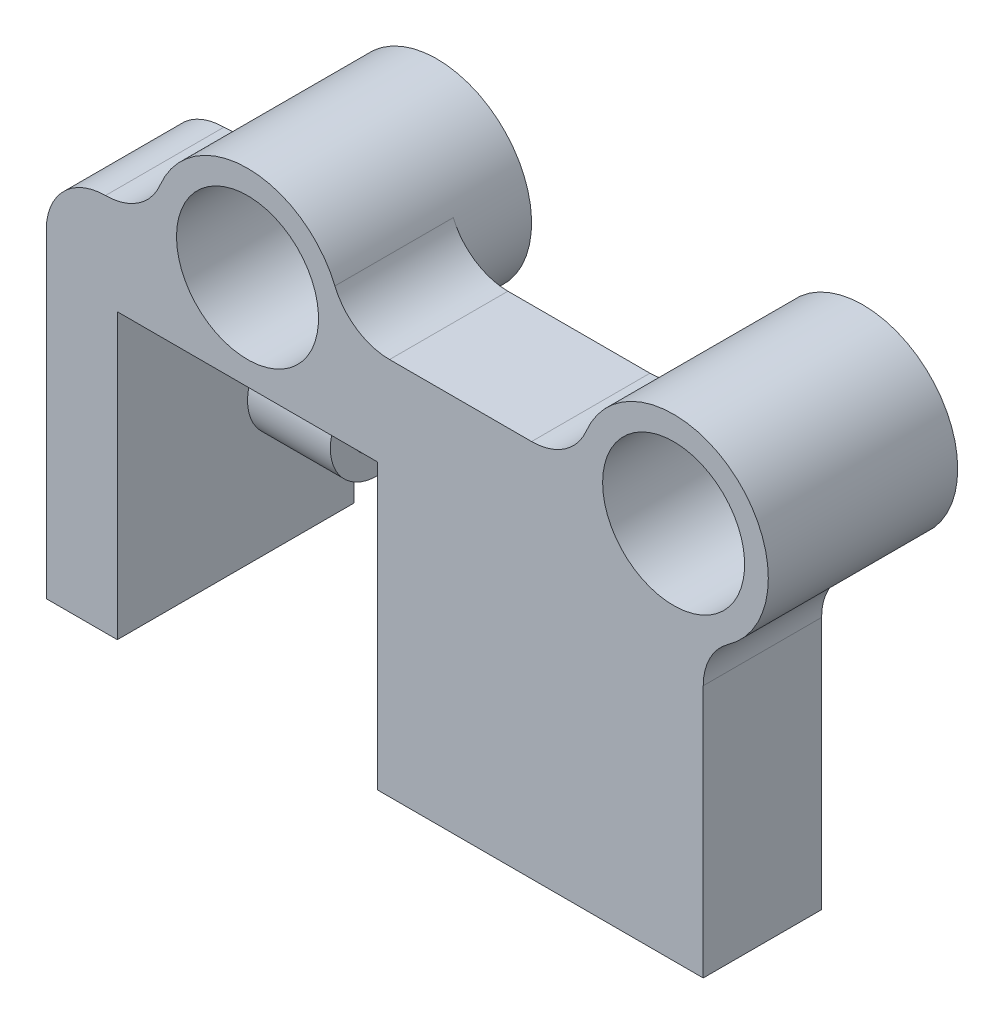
ISO-10303-21;
HEADER;
FILE_DESCRIPTION(('STEP AP214'),'2;1');
FILE_NAME('part.step','',(''),(''),'','','');
FILE_SCHEMA(('AUTOMOTIVE_DESIGN { 1 0 10303 214 1 1 1 1 }'));
ENDSEC;
DATA;
#1=APPLICATION_CONTEXT('core data for automotive mechanical design processes');
#2=APPLICATION_PROTOCOL_DEFINITION('international standard','automotive_design',2000,#1);
#3=PRODUCT_CONTEXT('',#1,'mechanical');
#4=PRODUCT('Part','Part','',(#3));
#5=PRODUCT_RELATED_PRODUCT_CATEGORY('part','',(#4));
#6=PRODUCT_DEFINITION_FORMATION('','',#4);
#7=PRODUCT_DEFINITION_CONTEXT('part definition',#1,'design');
#8=PRODUCT_DEFINITION('design','',#6,#7);
#9=PRODUCT_DEFINITION_SHAPE('','',#8);
#10=(LENGTH_UNIT() NAMED_UNIT(*) SI_UNIT(.MILLI.,.METRE.));
#11=(NAMED_UNIT(*) PLANE_ANGLE_UNIT() SI_UNIT($,.RADIAN.));
#12=(NAMED_UNIT(*) SI_UNIT($,.STERADIAN.) SOLID_ANGLE_UNIT());
#13=UNCERTAINTY_MEASURE_WITH_UNIT(LENGTH_MEASURE(1.E-05),#10,'distance_accuracy_value','');
#14=(GEOMETRIC_REPRESENTATION_CONTEXT(3) GLOBAL_UNCERTAINTY_ASSIGNED_CONTEXT((#13)) GLOBAL_UNIT_ASSIGNED_CONTEXT((#10,
#11,#12)) REPRESENTATION_CONTEXT('',''));
#15=CARTESIAN_POINT('',(0.,0.,0.));
#16=DIRECTION('',(0.,0.,1.));
#17=DIRECTION('',(1.,0.,0.));
#18=AXIS2_PLACEMENT_3D('',#15,#16,#17);
#19=CARTESIAN_POINT('',(8.,32.,0.));
#20=DIRECTION('',(0.,0.,-1.));
#21=DIRECTION('',(-1.,0.,0.));
#22=AXIS2_PLACEMENT_3D('',#19,#20,#21);
#23=PLANE('',#22);
#24=DIRECTION('',(-1.,0.,0.));
#25=VECTOR('',#24,1.);
#26=CARTESIAN_POINT('',(46.7550020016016,27.,0.));
#27=LINE('',#26,#25);
#28=CARTESIAN_POINT('',(44.6933761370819,27.,0.));
#29=VERTEX_POINT('',#28);
#30=CARTESIAN_POINT('',(34.,27.,0.));
#31=VERTEX_POINT('',#30);
#32=EDGE_CURVE('E473',#29,#31,#27,.T.);
#33=ORIENTED_EDGE('',*,*,#32,.F.);
#34=CARTESIAN_POINT('',(44.6933761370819,22.,0.));
#35=DIRECTION('',(0.,0.,-1.));
#36=DIRECTION('',(-1.,0.,0.));
#37=AXIS2_PLACEMENT_3D('',#34,#35,#36);
#38=CIRCLE('',#37,5.);
#39=CARTESIAN_POINT('',(47.8882314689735,25.8461538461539,0.));
#40=VERTEX_POINT('',#39);
#41=EDGE_CURVE('E557',#29,#40,#38,.T.);
#42=ORIENTED_EDGE('',*,*,#41,.T.);
#43=CARTESIAN_POINT('',(53.,32.,0.));
#44=DIRECTION('',(0.,0.,-1.));
#45=DIRECTION('',(-1.,0.,0.));
#46=AXIS2_PLACEMENT_3D('',#43,#44,#45);
#47=CIRCLE('',#46,8.);
#48=CARTESIAN_POINT('',(48.3846153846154,25.4656121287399,0.));
#49=VERTEX_POINT('',#48);
#50=EDGE_CURVE('E504',#49,#40,#47,.T.);
#51=ORIENTED_EDGE('',*,*,#50,.F.);
#52=CARTESIAN_POINT('',(45.5,21.3816197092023,0.));
#53=DIRECTION('',(0.,0.,-1.));
#54=DIRECTION('',(-1.,0.,0.));
#55=AXIS2_PLACEMENT_3D('',#52,#53,#54);
#56=CIRCLE('',#55,5.);
#57=CARTESIAN_POINT('',(50.5,21.3816197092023,0.));
#58=VERTEX_POINT('',#57);
#59=EDGE_CURVE('E555',#49,#58,#56,.T.);
#60=ORIENTED_EDGE('',*,*,#59,.T.);
#61=DIRECTION('',(0.,1.,0.));
#62=VECTOR('',#61,1.);
#63=CARTESIAN_POINT('',(50.5,0.,0.));
#64=LINE('',#63,#62);
#65=CARTESIAN_POINT('',(50.5,0.,0.));
#66=VERTEX_POINT('',#65);
#67=EDGE_CURVE('E459',#66,#58,#64,.T.);
#68=ORIENTED_EDGE('',*,*,#67,.F.);
#69=DIRECTION('',(1.,0.,0.));
#70=VECTOR('',#69,1.);
#71=CARTESIAN_POINT('',(28.,0.,0.));
#72=LINE('',#71,#70);
#73=CARTESIAN_POINT('',(34.,0.,0.));
#74=VERTEX_POINT('',#73);
#75=EDGE_CURVE('E512',#74,#66,#72,.T.);
#76=ORIENTED_EDGE('',*,*,#75,.F.);
#77=DIRECTION('',(0.,1.,0.));
#78=VECTOR('',#77,1.);
#79=CARTESIAN_POINT('',(34.,0.,0.));
#80=LINE('',#79,#78);
#81=EDGE_CURVE('E364',#74,#31,#80,.T.);
#82=ORIENTED_EDGE('',*,*,#81,.T.);
#83=EDGE_LOOP('',(#33,#42,#51,#60,#68,#76,#82));
#84=FACE_BOUND('',#83,.T.);
#85=ADVANCED_FACE('F42',(#84),#23,.T.);
#86=CARTESIAN_POINT('',(46.7550020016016,27.,-5.));
#87=DIRECTION('',(0.,1.,0.));
#88=DIRECTION('',(0.,0.,1.));
#89=AXIS2_PLACEMENT_3D('',#86,#87,#88);
#90=PLANE('',#89);
#91=DIRECTION('',(-1.,0.,0.));
#92=VECTOR('',#91,1.);
#93=CARTESIAN_POINT('',(46.7550020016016,27.,-5.));
#94=LINE('',#93,#92);
#95=CARTESIAN_POINT('',(44.6933761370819,27.,-5.));
#96=VERTEX_POINT('',#95);
#97=CARTESIAN_POINT('',(34.,27.,-5.));
#98=VERTEX_POINT('',#97);
#99=EDGE_CURVE('E474',#96,#98,#94,.T.);
#100=ORIENTED_EDGE('',*,*,#99,.F.);
#101=DIRECTION('',(0.,0.,1.));
#102=VECTOR('',#101,1.);
#103=CARTESIAN_POINT('',(44.6933761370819,27.,0.));
#104=LINE('',#103,#102);
#105=EDGE_CURVE('E548',#96,#29,#104,.T.);
#106=ORIENTED_EDGE('',*,*,#105,.T.);
#107=ORIENTED_EDGE('',*,*,#32,.T.);
#108=DIRECTION('',(0.,0.,-1.));
#109=VECTOR('',#108,1.);
#110=CARTESIAN_POINT('',(34.,27.,-5.));
#111=LINE('',#110,#109);
#112=EDGE_CURVE('E367',#31,#98,#111,.T.);
#113=ORIENTED_EDGE('',*,*,#112,.T.);
#114=EDGE_LOOP('',(#100,#106,#107,#113));
#115=FACE_BOUND('',#114,.T.);
#116=ADVANCED_FACE('F672',(#115),#90,.F.);
#117=DIRECTION('',(-1.,0.,0.));
#118=VECTOR('',#117,1.);
#119=CARTESIAN_POINT('',(10.7550020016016,27.,0.));
#120=LINE('',#119,#118);
#121=CARTESIAN_POINT('',(8.69337613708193,27.,0.));
#122=VERTEX_POINT('',#121);
#123=CARTESIAN_POINT('',(6.,27.,0.));
#124=VERTEX_POINT('',#123);
#125=EDGE_CURVE('E447',#122,#124,#120,.T.);
#126=ORIENTED_EDGE('',*,*,#125,.F.);
#127=CARTESIAN_POINT('',(8.69337613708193,22.,0.));
#128=DIRECTION('',(0.,0.,-1.));
#129=DIRECTION('',(-1.,0.,0.));
#130=AXIS2_PLACEMENT_3D('',#127,#128,#129);
#131=CIRCLE('',#130,5.);
#132=CARTESIAN_POINT('',(11.8882314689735,25.8461538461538,0.));
#133=VERTEX_POINT('',#132);
#134=EDGE_CURVE('E597',#122,#133,#131,.T.);
#135=ORIENTED_EDGE('',*,*,#134,.T.);
#136=CARTESIAN_POINT('',(17.,32.,0.));
#137=DIRECTION('',(0.,0.,-1.));
#138=DIRECTION('',(-1.,0.,0.));
#139=AXIS2_PLACEMENT_3D('',#136,#137,#138);
#140=CIRCLE('',#139,8.);
#141=CARTESIAN_POINT('',(17.,24.,0.));
#142=VERTEX_POINT('',#141);
#143=EDGE_CURVE('E507',#133,#142,#140,.F.);
#144=ORIENTED_EDGE('',*,*,#143,.T.);
#145=DIRECTION('',(1.,0.,0.));
#146=VECTOR('',#145,1.);
#147=CARTESIAN_POINT('',(6.,24.,0.));
#148=LINE('',#147,#146);
#149=CARTESIAN_POINT('',(6.,24.,0.));
#150=VERTEX_POINT('',#149);
#151=EDGE_CURVE('E527',#150,#142,#148,.T.);
#152=ORIENTED_EDGE('',*,*,#151,.F.);
#153=DIRECTION('',(0.,1.,0.));
#154=VECTOR('',#153,1.);
#155=CARTESIAN_POINT('',(6.,0.,0.));
#156=LINE('',#155,#154);
#157=EDGE_CURVE('E405',#150,#124,#156,.T.);
#158=ORIENTED_EDGE('',*,*,#157,.T.);
#159=EDGE_LOOP('',(#126,#135,#144,#152,#158));
#160=FACE_BOUND('',#159,.T.);
#161=ADVANCED_FACE('F711',(#160),#23,.T.);
#162=CARTESIAN_POINT('',(10.7550020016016,27.,-5.));
#163=DIRECTION('',(0.,1.,0.));
#164=DIRECTION('',(0.,0.,1.));
#165=AXIS2_PLACEMENT_3D('',#162,#163,#164);
#166=PLANE('',#165);
#167=DIRECTION('',(-1.,0.,0.));
#168=VECTOR('',#167,1.);
#169=CARTESIAN_POINT('',(10.7550020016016,27.,-5.));
#170=LINE('',#169,#168);
#171=CARTESIAN_POINT('',(8.69337613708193,27.,-5.));
#172=VERTEX_POINT('',#171);
#173=CARTESIAN_POINT('',(6.,27.,-5.));
#174=VERTEX_POINT('',#173);
#175=EDGE_CURVE('E446',#172,#174,#170,.T.);
#176=ORIENTED_EDGE('',*,*,#175,.F.);
#177=DIRECTION('',(0.,0.,-1.));
#178=VECTOR('',#177,1.);
#179=CARTESIAN_POINT('',(8.69337613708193,27.,0.));
#180=LINE('',#179,#178);
#181=EDGE_CURVE('E594',#172,#122,#180,.F.);
#182=ORIENTED_EDGE('',*,*,#181,.T.);
#183=ORIENTED_EDGE('',*,*,#125,.T.);
#184=DIRECTION('',(0.,0.,-1.));
#185=VECTOR('',#184,1.);
#186=CARTESIAN_POINT('',(6.,27.,-5.));
#187=LINE('',#186,#185);
#188=EDGE_CURVE('E408',#124,#174,#187,.T.);
#189=ORIENTED_EDGE('',*,*,#188,.T.);
#190=EDGE_LOOP('',(#176,#182,#183,#189));
#191=FACE_BOUND('',#190,.T.);
#192=ADVANCED_FACE('F722',(#191),#166,.F.);
#193=CARTESIAN_POINT('',(17.,32.,-11.));
#194=DIRECTION('',(0.,0.,1.));
#195=DIRECTION('',(1.,0.,0.));
#196=AXIS2_PLACEMENT_3D('',#193,#194,#195);
#197=CYLINDRICAL_SURFACE('',#196,8.);
#198=CARTESIAN_POINT('',(17.,32.,-11.));
#199=DIRECTION('',(0.,0.,-1.));
#200=DIRECTION('',(-1.,0.,0.));
#201=AXIS2_PLACEMENT_3D('',#198,#199,#200);
#202=CIRCLE('',#201,8.);
#203=CARTESIAN_POINT('',(9.,32.,-11.));
#204=VERTEX_POINT('',#203);
#205=EDGE_CURVE('E490',#204,#204,#202,.T.);
#206=ORIENTED_EDGE('',*,*,#205,.F.);
#207=EDGE_LOOP('',(#206));
#208=FACE_BOUND('',#207,.T.);
#209=CARTESIAN_POINT('',(17.,32.,-5.));
#210=DIRECTION('',(0.,0.,1.));
#211=DIRECTION('',(-1.,0.,0.));
#212=AXIS2_PLACEMENT_3D('',#209,#210,#211);
#213=CIRCLE('',#212,8.);
#214=CARTESIAN_POINT('',(9.61538461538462,35.0769230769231,-5.));
#215=VERTEX_POINT('',#214);
#216=CARTESIAN_POINT('',(11.8882314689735,25.8461538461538,-5.));
#217=VERTEX_POINT('',#216);
#218=EDGE_CURVE('E450',#215,#217,#213,.T.);
#219=ORIENTED_EDGE('',*,*,#218,.F.);
#220=DIRECTION('',(0.,0.,1.));
#221=VECTOR('',#220,1.);
#222=CARTESIAN_POINT('',(9.61538461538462,35.0769230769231,-11.));
#223=LINE('',#222,#221);
#224=CARTESIAN_POINT('',(9.61538461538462,35.0769230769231,5.));
#225=VERTEX_POINT('',#224);
#226=EDGE_CURVE('E580',#215,#225,#223,.T.);
#227=ORIENTED_EDGE('',*,*,#226,.T.);
#228=CARTESIAN_POINT('',(17.,32.,5.));
#229=DIRECTION('',(0.,0.,-1.));
#230=DIRECTION('',(-1.,0.,0.));
#231=AXIS2_PLACEMENT_3D('',#228,#229,#230);
#232=CIRCLE('',#231,8.00000000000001);
#233=CARTESIAN_POINT('',(24.3846153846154,35.0769230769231,5.));
#234=VERTEX_POINT('',#233);
#235=EDGE_CURVE('E440',#225,#234,#232,.T.);
#236=ORIENTED_EDGE('',*,*,#235,.T.);
#237=DIRECTION('',(0.,0.,1.));
#238=VECTOR('',#237,1.);
#239=CARTESIAN_POINT('',(24.3846153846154,35.0769230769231,-11.));
#240=LINE('',#239,#238);
#241=CARTESIAN_POINT('',(24.3846153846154,35.0769230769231,-5.));
#242=VERTEX_POINT('',#241);
#243=EDGE_CURVE('E577',#234,#242,#240,.F.);
#244=ORIENTED_EDGE('',*,*,#243,.T.);
#245=CARTESIAN_POINT('',(17.,32.,-5.));
#246=DIRECTION('',(0.,0.,1.));
#247=DIRECTION('',(-1.,0.,0.));
#248=AXIS2_PLACEMENT_3D('',#245,#246,#247);
#249=CIRCLE('',#248,8.);
#250=CARTESIAN_POINT('',(22.1117685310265,25.8461538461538,-5.));
#251=VERTEX_POINT('',#250);
#252=EDGE_CURVE('E476',#251,#242,#249,.T.);
#253=ORIENTED_EDGE('',*,*,#252,.F.);
#254=DIRECTION('',(0.,0.,1.));
#255=VECTOR('',#254,1.);
#256=CARTESIAN_POINT('',(22.1117685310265,25.8461538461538,-11.));
#257=LINE('',#256,#255);
#258=CARTESIAN_POINT('',(22.1117685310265,25.8461538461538,0.));
#259=VERTEX_POINT('',#258);
#260=EDGE_CURVE('E571',#251,#259,#257,.T.);
#261=ORIENTED_EDGE('',*,*,#260,.T.);
#262=CARTESIAN_POINT('',(17.,32.,0.));
#263=DIRECTION('',(0.,0.,-1.));
#264=DIRECTION('',(-1.,0.,0.));
#265=AXIS2_PLACEMENT_3D('',#262,#263,#264);
#266=CIRCLE('',#265,8.);
#267=EDGE_CURVE('E495',#259,#142,#266,.T.);
#268=ORIENTED_EDGE('',*,*,#267,.T.);
#269=ORIENTED_EDGE('',*,*,#143,.F.);
#270=DIRECTION('',(0.,0.,1.));
#271=VECTOR('',#270,1.);
#272=CARTESIAN_POINT('',(11.8882314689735,25.8461538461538,-11.));
#273=LINE('',#272,#271);
#274=EDGE_CURVE('E574',#133,#217,#273,.F.);
#275=ORIENTED_EDGE('',*,*,#274,.T.);
#276=EDGE_LOOP('',(#219,#227,#236,#244,#253,#261,#268,#269,#275));
#277=FACE_BOUND('',#276,.T.);
#278=ADVANCED_FACE('F695',(#208,#277),#197,.T.);
#279=ORIENTED_EDGE('',*,*,#267,.F.);
#280=CARTESIAN_POINT('',(25.3066238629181,22.,0.));
#281=DIRECTION('',(0.,0.,-1.));
#282=DIRECTION('',(-1.,0.,0.));
#283=AXIS2_PLACEMENT_3D('',#280,#281,#282);
#284=CIRCLE('',#283,5.);
#285=CARTESIAN_POINT('',(25.3066238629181,27.,0.));
#286=VERTEX_POINT('',#285);
#287=EDGE_CURVE('E599',#259,#286,#284,.T.);
#288=ORIENTED_EDGE('',*,*,#287,.T.);
#289=CARTESIAN_POINT('',(28.,27.,0.));
#290=VERTEX_POINT('',#289);
#291=EDGE_CURVE('E461',#290,#286,#27,.T.);
#292=ORIENTED_EDGE('',*,*,#291,.F.);
#293=DIRECTION('',(0.,1.,0.));
#294=VECTOR('',#293,1.);
#295=CARTESIAN_POINT('',(28.,0.,0.));
#296=LINE('',#295,#294);
#297=CARTESIAN_POINT('',(28.,24.,0.));
#298=VERTEX_POINT('',#297);
#299=EDGE_CURVE('E363',#298,#290,#296,.T.);
#300=ORIENTED_EDGE('',*,*,#299,.F.);
#301=EDGE_CURVE('E503',#142,#298,#148,.T.);
#302=ORIENTED_EDGE('',*,*,#301,.F.);
#303=EDGE_LOOP('',(#279,#288,#292,#300,#302));
#304=FACE_BOUND('',#303,.T.);
#305=ADVANCED_FACE('F699',(#304),#23,.T.);
#306=CARTESIAN_POINT('',(53.,32.,5.));
#307=DIRECTION('',(0.,0.,-1.));
#308=DIRECTION('',(-1.,0.,0.));
#309=AXIS2_PLACEMENT_3D('',#306,#307,#308);
#310=CYLINDRICAL_SURFACE('',#309,8.);
#311=ORIENTED_EDGE('',*,*,#50,.T.);
#312=DIRECTION('',(0.,0.,-1.));
#313=VECTOR('',#312,1.);
#314=CARTESIAN_POINT('',(47.8882314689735,25.8461538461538,5.));
#315=LINE('',#314,#313);
#316=CARTESIAN_POINT('',(47.8882314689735,25.8461538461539,-5.));
#317=VERTEX_POINT('',#316);
#318=EDGE_CURVE('E568',#40,#317,#315,.T.);
#319=ORIENTED_EDGE('',*,*,#318,.T.);
#320=CARTESIAN_POINT('',(53.,32.,-5.));
#321=DIRECTION('',(0.,0.,1.));
#322=DIRECTION('',(-1.,0.,0.));
#323=AXIS2_PLACEMENT_3D('',#320,#321,#322);
#324=CIRCLE('',#323,7.99999999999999);
#325=CARTESIAN_POINT('',(45.6153846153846,35.0769230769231,-5.));
#326=VERTEX_POINT('',#325);
#327=EDGE_CURVE('E470',#326,#317,#324,.T.);
#328=ORIENTED_EDGE('',*,*,#327,.F.);
#329=DIRECTION('',(0.,0.,-1.));
#330=VECTOR('',#329,1.);
#331=CARTESIAN_POINT('',(45.6153846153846,35.0769230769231,5.));
#332=LINE('',#331,#330);
#333=CARTESIAN_POINT('',(45.6153846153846,35.0769230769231,5.));
#334=VERTEX_POINT('',#333);
#335=EDGE_CURVE('E565',#326,#334,#332,.F.);
#336=ORIENTED_EDGE('',*,*,#335,.T.);
#337=CARTESIAN_POINT('',(53.,32.,5.));
#338=DIRECTION('',(0.,0.,1.));
#339=DIRECTION('',(-1.,0.,0.));
#340=AXIS2_PLACEMENT_3D('',#337,#338,#339);
#341=CIRCLE('',#340,8.);
#342=CARTESIAN_POINT('',(57.6153846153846,25.4656121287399,5.));
#343=VERTEX_POINT('',#342);
#344=EDGE_CURVE('E523',#343,#334,#341,.T.);
#345=ORIENTED_EDGE('',*,*,#344,.F.);
#346=DIRECTION('',(0.,0.,-1.));
#347=VECTOR('',#346,1.);
#348=CARTESIAN_POINT('',(57.6153846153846,25.4656121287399,5.));
#349=LINE('',#348,#347);
#350=CARTESIAN_POINT('',(57.6153846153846,25.4656121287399,-5.));
#351=VERTEX_POINT('',#350);
#352=EDGE_CURVE('E559',#343,#351,#349,.T.);
#353=ORIENTED_EDGE('',*,*,#352,.T.);
#354=CARTESIAN_POINT('',(53.,32.,-5.));
#355=DIRECTION('',(0.,0.,1.));
#356=DIRECTION('',(-1.,0.,0.));
#357=AXIS2_PLACEMENT_3D('',#354,#355,#356);
#358=CIRCLE('',#357,8.);
#359=CARTESIAN_POINT('',(48.3846153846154,25.4656121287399,-5.));
#360=VERTEX_POINT('',#359);
#361=EDGE_CURVE('E464',#360,#351,#358,.T.);
#362=ORIENTED_EDGE('',*,*,#361,.F.);
#363=DIRECTION('',(0.,0.,-1.));
#364=VECTOR('',#363,1.);
#365=CARTESIAN_POINT('',(48.3846153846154,25.4656121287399,5.));
#366=LINE('',#365,#364);
#367=EDGE_CURVE('E562',#360,#49,#366,.F.);
#368=ORIENTED_EDGE('',*,*,#367,.T.);
#369=EDGE_LOOP('',(#311,#319,#328,#336,#345,#353,#362,#368));
#370=FACE_BOUND('',#369,.T.);
#371=CARTESIAN_POINT('',(53.,32.,-11.));
#372=DIRECTION('',(0.,0.,-1.));
#373=DIRECTION('',(-1.,0.,0.));
#374=AXIS2_PLACEMENT_3D('',#371,#372,#373);
#375=CIRCLE('',#374,8.);
#376=CARTESIAN_POINT('',(45.,32.,-11.));
#377=VERTEX_POINT('',#376);
#378=EDGE_CURVE('E498',#377,#377,#375,.T.);
#379=ORIENTED_EDGE('',*,*,#378,.F.);
#380=EDGE_LOOP('',(#379));
#381=FACE_BOUND('',#380,.T.);
#382=ADVANCED_FACE('F641',(#370,#381),#310,.T.);
#383=CARTESIAN_POINT('',(0.,0.,5.));
#384=DIRECTION('',(1.,0.,0.));
#385=DIRECTION('',(0.,0.,-1.));
#386=AXIS2_PLACEMENT_3D('',#383,#384,#385);
#387=PLANE('',#386);
#388=CARTESIAN_POINT('',(0.,12.,-10.));
#389=DIRECTION('',(-1.,0.,0.));
#390=DIRECTION('',(0.,0.,1.));
#391=AXIS2_PLACEMENT_3D('',#388,#389,#390);
#392=CIRCLE('',#391,4.);
#393=CARTESIAN_POINT('',(0.,12.,-6.));
#394=VERTEX_POINT('',#393);
#395=EDGE_CURVE('E344',#394,#394,#392,.T.);
#396=ORIENTED_EDGE('',*,*,#395,.F.);
#397=EDGE_LOOP('',(#396));
#398=FACE_BOUND('',#397,.T.);
#399=DIRECTION('',(0.,-1.,0.));
#400=VECTOR('',#399,1.);
#401=CARTESIAN_POINT('',(0.,0.,5.));
#402=LINE('',#401,#400);
#403=CARTESIAN_POINT('',(0.,27.,5.));
#404=VERTEX_POINT('',#403);
#405=CARTESIAN_POINT('',(0.,0.,5.));
#406=VERTEX_POINT('',#405);
#407=EDGE_CURVE('E509',#404,#406,#402,.T.);
#408=ORIENTED_EDGE('',*,*,#407,.F.);
#409=DIRECTION('',(0.,0.,-1.));
#410=VECTOR('',#409,1.);
#411=CARTESIAN_POINT('',(0.,27.,5.));
#412=LINE('',#411,#410);
#413=CARTESIAN_POINT('',(0.,27.,-5.));
#414=VERTEX_POINT('',#413);
#415=EDGE_CURVE('E588',#404,#414,#412,.T.);
#416=ORIENTED_EDGE('',*,*,#415,.T.);
#417=DIRECTION('',(0.,-0.499999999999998,-0.86602540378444));
#418=VECTOR('',#417,1.);
#419=CARTESIAN_POINT('',(0.,27.,-5.));
#420=LINE('',#419,#418);
#421=CARTESIAN_POINT('',(0.,23.5358983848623,-11.));
#422=VERTEX_POINT('',#421);
#423=EDGE_CURVE('E398',#414,#422,#420,.T.);
#424=ORIENTED_EDGE('',*,*,#423,.T.);
#425=CARTESIAN_POINT('',(0.,16.6076951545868,-7.));
#426=DIRECTION('',(-1.,0.,0.));
#427=DIRECTION('',(0.,0.,1.));
#428=AXIS2_PLACEMENT_3D('',#425,#426,#427);
#429=CIRCLE('',#428,8.00000000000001);
#430=CARTESIAN_POINT('',(0.,16.6076951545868,-15.));
#431=VERTEX_POINT('',#430);
#432=EDGE_CURVE('E424',#422,#431,#429,.T.);
#433=ORIENTED_EDGE('',*,*,#432,.T.);
#434=DIRECTION('',(0.,-1.,0.));
#435=VECTOR('',#434,1.);
#436=CARTESIAN_POINT('',(0.,16.6076951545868,-15.));
#437=LINE('',#436,#435);
#438=CARTESIAN_POINT('',(0.,0.,-15.));
#439=VERTEX_POINT('',#438);
#440=EDGE_CURVE('E409',#431,#439,#437,.T.);
#441=ORIENTED_EDGE('',*,*,#440,.T.);
#442=DIRECTION('',(0.,0.,-1.));
#443=VECTOR('',#442,1.);
#444=CARTESIAN_POINT('',(0.,0.,5.));
#445=LINE('',#444,#443);
#446=EDGE_CURVE('E508',#406,#439,#445,.T.);
#447=ORIENTED_EDGE('',*,*,#446,.F.);
#448=EDGE_LOOP('',(#408,#416,#424,#433,#441,#447));
#449=FACE_BOUND('',#448,.T.);
#450=ADVANCED_FACE('F838',(#398,#449),#387,.F.);
#451=CARTESIAN_POINT('',(0.,0.,5.));
#452=DIRECTION('',(0.,1.,0.));
#453=DIRECTION('',(0.,0.,1.));
#454=AXIS2_PLACEMENT_3D('',#451,#452,#453);
#455=PLANE('',#454);
#456=ORIENTED_EDGE('',*,*,#446,.T.);
#457=DIRECTION('',(-1.,0.,0.));
#458=VECTOR('',#457,1.);
#459=CARTESIAN_POINT('',(6.,0.,-15.));
#460=LINE('',#459,#458);
#461=CARTESIAN_POINT('',(6.,0.,-15.));
#462=VERTEX_POINT('',#461);
#463=EDGE_CURVE('E429',#462,#439,#460,.T.);
#464=ORIENTED_EDGE('',*,*,#463,.F.);
#465=DIRECTION('',(0.,0.,-1.));
#466=VECTOR('',#465,1.);
#467=CARTESIAN_POINT('',(6.,0.,5.));
#468=LINE('',#467,#466);
#469=CARTESIAN_POINT('',(6.,0.,5.));
#470=VERTEX_POINT('',#469);
#471=EDGE_CURVE('E538',#470,#462,#468,.T.);
#472=ORIENTED_EDGE('',*,*,#471,.F.);
#473=DIRECTION('',(1.,0.,0.));
#474=VECTOR('',#473,1.);
#475=CARTESIAN_POINT('',(0.,0.,5.));
#476=LINE('',#475,#474);
#477=EDGE_CURVE('E511',#406,#470,#476,.T.);
#478=ORIENTED_EDGE('',*,*,#477,.F.);
#479=EDGE_LOOP('',(#456,#464,#472,#478));
#480=FACE_BOUND('',#479,.T.);
#481=ADVANCED_FACE('F834',(#480),#455,.F.);
#482=CARTESIAN_POINT('',(6.,0.,5.));
#483=DIRECTION('',(-1.,0.,0.));
#484=DIRECTION('',(0.,0.,1.));
#485=AXIS2_PLACEMENT_3D('',#482,#483,#484);
#486=PLANE('',#485);
#487=CARTESIAN_POINT('',(6.,12.,-10.));
#488=DIRECTION('',(-1.,0.,0.));
#489=DIRECTION('',(0.,0.,1.));
#490=AXIS2_PLACEMENT_3D('',#487,#488,#489);
#491=CIRCLE('',#490,4.);
#492=CARTESIAN_POINT('',(6.,12.,-6.));
#493=VERTEX_POINT('',#492);
#494=EDGE_CURVE('E542',#493,#493,#491,.F.);
#495=ORIENTED_EDGE('',*,*,#494,.F.);
#496=EDGE_LOOP('',(#495));
#497=FACE_BOUND('',#496,.T.);
#498=ORIENTED_EDGE('',*,*,#471,.T.);
#499=DIRECTION('',(0.,-1.,0.));
#500=VECTOR('',#499,1.);
#501=CARTESIAN_POINT('',(6.,16.6076951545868,-15.));
#502=LINE('',#501,#500);
#503=CARTESIAN_POINT('',(6.,16.6076951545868,-15.));
#504=VERTEX_POINT('',#503);
#505=EDGE_CURVE('E418',#504,#462,#502,.T.);
#506=ORIENTED_EDGE('',*,*,#505,.F.);
#507=CARTESIAN_POINT('',(6.,16.6076951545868,-7.));
#508=DIRECTION('',(-1.,0.,0.));
#509=DIRECTION('',(0.,0.,1.));
#510=AXIS2_PLACEMENT_3D('',#507,#508,#509);
#511=CIRCLE('',#510,8.00000000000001);
#512=CARTESIAN_POINT('',(6.,23.5358983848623,-11.));
#513=VERTEX_POINT('',#512);
#514=EDGE_CURVE('E415',#513,#504,#511,.T.);
#515=ORIENTED_EDGE('',*,*,#514,.F.);
#516=DIRECTION('',(0.,-0.499999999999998,-0.86602540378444));
#517=VECTOR('',#516,1.);
#518=CARTESIAN_POINT('',(6.,27.,-5.));
#519=LINE('',#518,#517);
#520=EDGE_CURVE('E412',#174,#513,#519,.T.);
#521=ORIENTED_EDGE('',*,*,#520,.F.);
#522=ORIENTED_EDGE('',*,*,#188,.F.);
#523=ORIENTED_EDGE('',*,*,#157,.F.);
#524=DIRECTION('',(0.,0.,-1.));
#525=VECTOR('',#524,1.);
#526=CARTESIAN_POINT('',(6.,24.,5.));
#527=LINE('',#526,#525);
#528=CARTESIAN_POINT('',(6.,24.,5.));
#529=VERTEX_POINT('',#528);
#530=EDGE_CURVE('E535',#529,#150,#527,.T.);
#531=ORIENTED_EDGE('',*,*,#530,.F.);
#532=DIRECTION('',(0.,1.,0.));
#533=VECTOR('',#532,1.);
#534=CARTESIAN_POINT('',(6.,0.,5.));
#535=LINE('',#534,#533);
#536=EDGE_CURVE('E514',#470,#529,#535,.T.);
#537=ORIENTED_EDGE('',*,*,#536,.F.);
#538=EDGE_LOOP('',(#498,#506,#515,#521,#522,#523,#531,#537));
#539=FACE_BOUND('',#538,.T.);
#540=ADVANCED_FACE('F726',(#497,#539),#486,.F.);
#541=CARTESIAN_POINT('',(6.,24.,5.));
#542=DIRECTION('',(0.,1.,0.));
#543=DIRECTION('',(0.,0.,1.));
#544=AXIS2_PLACEMENT_3D('',#541,#542,#543);
#545=PLANE('',#544);
#546=ORIENTED_EDGE('',*,*,#151,.T.);
#547=ORIENTED_EDGE('',*,*,#301,.T.);
#548=DIRECTION('',(0.,0.,-1.));
#549=VECTOR('',#548,1.);
#550=CARTESIAN_POINT('',(28.,24.,5.));
#551=LINE('',#550,#549);
#552=CARTESIAN_POINT('',(28.,24.,5.));
#553=VERTEX_POINT('',#552);
#554=EDGE_CURVE('E532',#553,#298,#551,.T.);
#555=ORIENTED_EDGE('',*,*,#554,.F.);
#556=DIRECTION('',(1.,0.,0.));
#557=VECTOR('',#556,1.);
#558=CARTESIAN_POINT('',(6.,24.,5.));
#559=LINE('',#558,#557);
#560=EDGE_CURVE('E516',#529,#553,#559,.T.);
#561=ORIENTED_EDGE('',*,*,#560,.F.);
#562=ORIENTED_EDGE('',*,*,#530,.T.);
#563=EDGE_LOOP('',(#546,#547,#555,#561,#562));
#564=FACE_BOUND('',#563,.T.);
#565=ADVANCED_FACE('F706',(#564),#545,.F.);
#566=CARTESIAN_POINT('',(28.,0.,5.));
#567=DIRECTION('',(1.,0.,0.));
#568=DIRECTION('',(0.,0.,-1.));
#569=AXIS2_PLACEMENT_3D('',#566,#567,#568);
#570=PLANE('',#569);
#571=CARTESIAN_POINT('',(28.,12.,-10.));
#572=DIRECTION('',(1.,0.,0.));
#573=DIRECTION('',(0.,0.,-1.));
#574=AXIS2_PLACEMENT_3D('',#571,#572,#573);
#575=CIRCLE('',#574,4.);
#576=CARTESIAN_POINT('',(28.,12.,-14.));
#577=VERTEX_POINT('',#576);
#578=EDGE_CURVE('E545',#577,#577,#575,.F.);
#579=ORIENTED_EDGE('',*,*,#578,.F.);
#580=EDGE_LOOP('',(#579));
#581=FACE_BOUND('',#580,.T.);
#582=ORIENTED_EDGE('',*,*,#554,.T.);
#583=ORIENTED_EDGE('',*,*,#299,.T.);
#584=DIRECTION('',(0.,0.,-1.));
#585=VECTOR('',#584,1.);
#586=CARTESIAN_POINT('',(28.,27.,-5.));
#587=LINE('',#586,#585);
#588=CARTESIAN_POINT('',(28.,27.,-5.));
#589=VERTEX_POINT('',#588);
#590=EDGE_CURVE('E385',#290,#589,#587,.T.);
#591=ORIENTED_EDGE('',*,*,#590,.T.);
#592=DIRECTION('',(0.,-0.499999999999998,-0.86602540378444));
#593=VECTOR('',#592,1.);
#594=CARTESIAN_POINT('',(28.,27.,-5.));
#595=LINE('',#594,#593);
#596=CARTESIAN_POINT('',(28.,23.5358983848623,-11.));
#597=VERTEX_POINT('',#596);
#598=EDGE_CURVE('E387',#589,#597,#595,.T.);
#599=ORIENTED_EDGE('',*,*,#598,.T.);
#600=CARTESIAN_POINT('',(28.,16.6076951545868,-7.));
#601=DIRECTION('',(-1.,0.,0.));
#602=DIRECTION('',(0.,0.,1.));
#603=AXIS2_PLACEMENT_3D('',#600,#601,#602);
#604=CIRCLE('',#603,8.00000000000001);
#605=CARTESIAN_POINT('',(28.,16.6076951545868,-15.));
#606=VERTEX_POINT('',#605);
#607=EDGE_CURVE('E390',#597,#606,#604,.T.);
#608=ORIENTED_EDGE('',*,*,#607,.T.);
#609=DIRECTION('',(0.,-1.,0.));
#610=VECTOR('',#609,1.);
#611=CARTESIAN_POINT('',(28.,16.6076951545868,-15.));
#612=LINE('',#611,#610);
#613=CARTESIAN_POINT('',(28.,0.,-15.));
#614=VERTEX_POINT('',#613);
#615=EDGE_CURVE('E368',#606,#614,#612,.T.);
#616=ORIENTED_EDGE('',*,*,#615,.T.);
#617=DIRECTION('',(0.,0.,-1.));
#618=VECTOR('',#617,1.);
#619=CARTESIAN_POINT('',(28.,0.,5.));
#620=LINE('',#619,#618);
#621=CARTESIAN_POINT('',(28.,0.,5.));
#622=VERTEX_POINT('',#621);
#623=EDGE_CURVE('E526',#622,#614,#620,.T.);
#624=ORIENTED_EDGE('',*,*,#623,.F.);
#625=DIRECTION('',(0.,-1.,0.));
#626=VECTOR('',#625,1.);
#627=CARTESIAN_POINT('',(28.,0.,5.));
#628=LINE('',#627,#626);
#629=EDGE_CURVE('E518',#553,#622,#628,.T.);
#630=ORIENTED_EDGE('',*,*,#629,.F.);
#631=EDGE_LOOP('',(#582,#583,#591,#599,#608,#616,#624,#630));
#632=FACE_BOUND('',#631,.T.);
#633=ADVANCED_FACE('F822',(#581,#632),#570,.F.);
#634=CARTESIAN_POINT('',(28.,0.,5.));
#635=DIRECTION('',(0.,1.,0.));
#636=DIRECTION('',(0.,0.,1.));
#637=AXIS2_PLACEMENT_3D('',#634,#635,#636);
#638=PLANE('',#637);
#639=DIRECTION('',(0.,0.,1.));
#640=VECTOR('',#639,1.);
#641=CARTESIAN_POINT('',(55.5,0.,-5.));
#642=LINE('',#641,#640);
#643=CARTESIAN_POINT('',(55.5,0.,-5.));
#644=VERTEX_POINT('',#643);
#645=CARTESIAN_POINT('',(55.5,0.,5.));
#646=VERTEX_POINT('',#645);
#647=EDGE_CURVE('E455',#644,#646,#642,.T.);
#648=ORIENTED_EDGE('',*,*,#647,.T.);
#649=DIRECTION('',(1.,0.,0.));
#650=VECTOR('',#649,1.);
#651=CARTESIAN_POINT('',(28.,0.,5.));
#652=LINE('',#651,#650);
#653=EDGE_CURVE('E520',#622,#646,#652,.T.);
#654=ORIENTED_EDGE('',*,*,#653,.F.);
#655=ORIENTED_EDGE('',*,*,#623,.T.);
#656=DIRECTION('',(-1.,0.,0.));
#657=VECTOR('',#656,1.);
#658=CARTESIAN_POINT('',(34.,0.,-15.));
#659=LINE('',#658,#657);
#660=CARTESIAN_POINT('',(34.,0.,-15.));
#661=VERTEX_POINT('',#660);
#662=EDGE_CURVE('E395',#661,#614,#659,.T.);
#663=ORIENTED_EDGE('',*,*,#662,.F.);
#664=DIRECTION('',(0.,0.,1.));
#665=VECTOR('',#664,1.);
#666=CARTESIAN_POINT('',(34.,0.,0.));
#667=LINE('',#666,#665);
#668=EDGE_CURVE('E380',#661,#74,#667,.T.);
#669=ORIENTED_EDGE('',*,*,#668,.T.);
#670=ORIENTED_EDGE('',*,*,#75,.T.);
#671=DIRECTION('',(0.,0.,1.));
#672=VECTOR('',#671,1.);
#673=CARTESIAN_POINT('',(50.5,0.,-5.));
#674=LINE('',#673,#672);
#675=CARTESIAN_POINT('',(50.5,0.,-5.));
#676=VERTEX_POINT('',#675);
#677=EDGE_CURVE('E449',#676,#66,#674,.T.);
#678=ORIENTED_EDGE('',*,*,#677,.F.);
#679=DIRECTION('',(-1.,0.,0.));
#680=VECTOR('',#679,1.);
#681=CARTESIAN_POINT('',(50.5,0.,-5.));
#682=LINE('',#681,#680);
#683=EDGE_CURVE('E462',#644,#676,#682,.T.);
#684=ORIENTED_EDGE('',*,*,#683,.F.);
#685=EDGE_LOOP('',(#648,#654,#655,#663,#669,#670,#678,#684));
#686=FACE_BOUND('',#685,.T.);
#687=ADVANCED_FACE('F652',(#686),#638,.F.);
#688=CARTESIAN_POINT('',(8.,32.,5.));
#689=DIRECTION('',(0.,0.,-1.));
#690=DIRECTION('',(-1.,0.,0.));
#691=AXIS2_PLACEMENT_3D('',#688,#689,#690);
#692=PLANE('',#691);
#693=ORIENTED_EDGE('',*,*,#235,.F.);
#694=CARTESIAN_POINT('',(5.,37.,5.));
#695=DIRECTION('',(0.,0.,-1.));
#696=DIRECTION('',(-1.,0.,0.));
#697=AXIS2_PLACEMENT_3D('',#694,#695,#696);
#698=CIRCLE('',#697,5.);
#699=CARTESIAN_POINT('',(5.,32.,5.));
#700=VERTEX_POINT('',#699);
#701=EDGE_CURVE('E609',#225,#700,#698,.T.);
#702=ORIENTED_EDGE('',*,*,#701,.T.);
#703=CARTESIAN_POINT('',(5.,27.,5.));
#704=DIRECTION('',(0.,0.,-1.));
#705=DIRECTION('',(-1.,0.,0.));
#706=AXIS2_PLACEMENT_3D('',#703,#704,#705);
#707=CIRCLE('',#706,5.);
#708=EDGE_CURVE('E592',#700,#404,#707,.F.);
#709=ORIENTED_EDGE('',*,*,#708,.T.);
#710=ORIENTED_EDGE('',*,*,#407,.T.);
#711=ORIENTED_EDGE('',*,*,#477,.T.);
#712=ORIENTED_EDGE('',*,*,#536,.T.);
#713=ORIENTED_EDGE('',*,*,#560,.T.);
#714=ORIENTED_EDGE('',*,*,#629,.T.);
#715=ORIENTED_EDGE('',*,*,#653,.T.);
#716=DIRECTION('',(0.,-1.,0.));
#717=VECTOR('',#716,1.);
#718=CARTESIAN_POINT('',(55.5,0.,5.));
#719=LINE('',#718,#717);
#720=CARTESIAN_POINT('',(55.5,21.3816197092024,5.));
#721=VERTEX_POINT('',#720);
#722=EDGE_CURVE('E432',#721,#646,#719,.T.);
#723=ORIENTED_EDGE('',*,*,#722,.F.);
#724=CARTESIAN_POINT('',(60.5,21.3816197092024,5.));
#725=DIRECTION('',(0.,0.,-1.));
#726=DIRECTION('',(-1.,0.,0.));
#727=AXIS2_PLACEMENT_3D('',#724,#725,#726);
#728=CIRCLE('',#727,5.);
#729=EDGE_CURVE('E51',#721,#343,#728,.T.);
#730=ORIENTED_EDGE('',*,*,#729,.T.);
#731=ORIENTED_EDGE('',*,*,#344,.T.);
#732=CARTESIAN_POINT('',(41.,37.,5.));
#733=DIRECTION('',(0.,0.,-1.));
#734=DIRECTION('',(-1.,0.,0.));
#735=AXIS2_PLACEMENT_3D('',#732,#733,#734);
#736=CIRCLE('',#735,5.);
#737=CARTESIAN_POINT('',(41.,32.,5.));
#738=VERTEX_POINT('',#737);
#739=EDGE_CURVE('E618',#334,#738,#736,.T.);
#740=ORIENTED_EDGE('',*,*,#739,.T.);
#741=DIRECTION('',(1.,0.,0.));
#742=VECTOR('',#741,1.);
#743=CARTESIAN_POINT('',(45.,32.,5.));
#744=LINE('',#743,#742);
#745=CARTESIAN_POINT('',(29.,32.,5.));
#746=VERTEX_POINT('',#745);
#747=EDGE_CURVE('E443',#746,#738,#744,.T.);
#748=ORIENTED_EDGE('',*,*,#747,.F.);
#749=CARTESIAN_POINT('',(29.,37.,5.));
#750=DIRECTION('',(0.,0.,-1.));
#751=DIRECTION('',(-1.,0.,0.));
#752=AXIS2_PLACEMENT_3D('',#749,#750,#751);
#753=CIRCLE('',#752,5.);
#754=EDGE_CURVE('E614',#746,#234,#753,.T.);
#755=ORIENTED_EDGE('',*,*,#754,.T.);
#756=EDGE_LOOP('',(#693,#702,#709,#710,#711,#712,#713,#714,#715,#723,#730,#731,#740,#748,#755));
#757=FACE_BOUND('',#756,.T.);
#758=CARTESIAN_POINT('',(53.,32.,5.));
#759=DIRECTION('',(0.,0.,-1.));
#760=DIRECTION('',(-1.,0.,0.));
#761=AXIS2_PLACEMENT_3D('',#758,#759,#760);
#762=CIRCLE('',#761,5.99999999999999);
#763=CARTESIAN_POINT('',(47.,32.,5.));
#764=VERTEX_POINT('',#763);
#765=EDGE_CURVE('E486',#764,#764,#762,.F.);
#766=ORIENTED_EDGE('',*,*,#765,.F.);
#767=EDGE_LOOP('',(#766));
#768=FACE_BOUND('',#767,.T.);
#769=CARTESIAN_POINT('',(17.,32.,5.));
#770=DIRECTION('',(0.,0.,-1.));
#771=DIRECTION('',(-1.,0.,0.));
#772=AXIS2_PLACEMENT_3D('',#769,#770,#771);
#773=CIRCLE('',#772,6.);
#774=CARTESIAN_POINT('',(11.,32.,5.));
#775=VERTEX_POINT('',#774);
#776=EDGE_CURVE('E481',#775,#775,#773,.F.);
#777=ORIENTED_EDGE('',*,*,#776,.F.);
#778=EDGE_LOOP('',(#777));
#779=FACE_BOUND('',#778,.T.);
#780=ADVANCED_FACE('F635',(#757,#768,#779),#692,.F.);
#781=CARTESIAN_POINT('',(53.,32.,-11.));
#782=DIRECTION('',(0.,0.,-1.));
#783=DIRECTION('',(-1.,0.,0.));
#784=AXIS2_PLACEMENT_3D('',#781,#782,#783);
#785=PLANE('',#784);
#786=CARTESIAN_POINT('',(53.,32.,-11.));
#787=DIRECTION('',(0.,0.,-1.));
#788=DIRECTION('',(-1.,0.,0.));
#789=AXIS2_PLACEMENT_3D('',#786,#787,#788);
#790=CIRCLE('',#789,5.99999999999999);
#791=CARTESIAN_POINT('',(47.,32.,-11.));
#792=VERTEX_POINT('',#791);
#793=EDGE_CURVE('E483',#792,#792,#790,.T.);
#794=ORIENTED_EDGE('',*,*,#793,.F.);
#795=EDGE_LOOP('',(#794));
#796=FACE_BOUND('',#795,.T.);
#797=ORIENTED_EDGE('',*,*,#378,.T.);
#798=EDGE_LOOP('',(#797));
#799=FACE_BOUND('',#798,.T.);
#800=ADVANCED_FACE('F814',(#796,#799),#785,.T.);
#801=CARTESIAN_POINT('',(17.,32.,-11.));
#802=DIRECTION('',(0.,0.,-1.));
#803=DIRECTION('',(-1.,0.,0.));
#804=AXIS2_PLACEMENT_3D('',#801,#802,#803);
#805=PLANE('',#804);
#806=CARTESIAN_POINT('',(17.,32.,-11.));
#807=DIRECTION('',(0.,0.,-1.));
#808=DIRECTION('',(-1.,0.,0.));
#809=AXIS2_PLACEMENT_3D('',#806,#807,#808);
#810=CIRCLE('',#809,6.);
#811=CARTESIAN_POINT('',(11.,32.,-11.));
#812=VERTEX_POINT('',#811);
#813=EDGE_CURVE('E487',#812,#812,#810,.T.);
#814=ORIENTED_EDGE('',*,*,#813,.F.);
#815=EDGE_LOOP('',(#814));
#816=FACE_BOUND('',#815,.T.);
#817=ORIENTED_EDGE('',*,*,#205,.T.);
#818=EDGE_LOOP('',(#817));
#819=FACE_BOUND('',#818,.T.);
#820=ADVANCED_FACE('F809',(#816,#819),#805,.T.);
#821=CARTESIAN_POINT('',(17.,32.,5.001));
#822=DIRECTION('',(0.,0.,-1.));
#823=DIRECTION('',(-1.,0.,0.));
#824=AXIS2_PLACEMENT_3D('',#821,#822,#823);
#825=CYLINDRICAL_SURFACE('',#824,6.);
#826=ORIENTED_EDGE('',*,*,#813,.T.);
#827=EDGE_LOOP('',(#826));
#828=FACE_BOUND('',#827,.T.);
#829=ORIENTED_EDGE('',*,*,#776,.T.);
#830=EDGE_LOOP('',(#829));
#831=FACE_BOUND('',#830,.T.);
#832=ADVANCED_FACE('F806',(#828,#831),#825,.F.);
#833=CARTESIAN_POINT('',(53.,32.,5.001));
#834=DIRECTION('',(0.,0.,-1.));
#835=DIRECTION('',(-1.,0.,0.));
#836=AXIS2_PLACEMENT_3D('',#833,#834,#835);
#837=CYLINDRICAL_SURFACE('',#836,5.99999999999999);
#838=ORIENTED_EDGE('',*,*,#793,.T.);
#839=EDGE_LOOP('',(#838));
#840=FACE_BOUND('',#839,.T.);
#841=ORIENTED_EDGE('',*,*,#765,.T.);
#842=EDGE_LOOP('',(#841));
#843=FACE_BOUND('',#842,.T.);
#844=ADVANCED_FACE('F803',(#840,#843),#837,.F.);
#845=ORIENTED_EDGE('',*,*,#291,.T.);
#846=DIRECTION('',(0.,0.,-1.));
#847=VECTOR('',#846,1.);
#848=CARTESIAN_POINT('',(25.3066238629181,27.,-5.));
#849=LINE('',#848,#847);
#850=CARTESIAN_POINT('',(25.3066238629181,27.,-5.));
#851=VERTEX_POINT('',#850);
#852=EDGE_CURVE('E601',#286,#851,#849,.T.);
#853=ORIENTED_EDGE('',*,*,#852,.T.);
#854=EDGE_CURVE('E472',#589,#851,#94,.T.);
#855=ORIENTED_EDGE('',*,*,#854,.F.);
#856=ORIENTED_EDGE('',*,*,#590,.F.);
#857=EDGE_LOOP('',(#845,#853,#855,#856));
#858=FACE_BOUND('',#857,.T.);
#859=ADVANCED_FACE('F772',(#858),#90,.F.);
#860=CARTESIAN_POINT('',(45.,32.,-5.));
#861=DIRECTION('',(0.,-1.,0.));
#862=DIRECTION('',(0.,0.,-1.));
#863=AXIS2_PLACEMENT_3D('',#860,#861,#862);
#864=PLANE('',#863);
#865=DIRECTION('',(1.,0.,0.));
#866=VECTOR('',#865,1.);
#867=CARTESIAN_POINT('',(45.,32.,-5.));
#868=LINE('',#867,#866);
#869=CARTESIAN_POINT('',(29.,32.,-5.));
#870=VERTEX_POINT('',#869);
#871=CARTESIAN_POINT('',(41.,32.,-5.));
#872=VERTEX_POINT('',#871);
#873=EDGE_CURVE('E478',#870,#872,#868,.T.);
#874=ORIENTED_EDGE('',*,*,#873,.F.);
#875=DIRECTION('',(0.,0.,-1.));
#876=VECTOR('',#875,1.);
#877=CARTESIAN_POINT('',(29.,32.,5.));
#878=LINE('',#877,#876);
#879=EDGE_CURVE('E585',#870,#746,#878,.F.);
#880=ORIENTED_EDGE('',*,*,#879,.T.);
#881=ORIENTED_EDGE('',*,*,#747,.T.);
#882=DIRECTION('',(0.,0.,1.));
#883=VECTOR('',#882,1.);
#884=CARTESIAN_POINT('',(41.,32.,-5.));
#885=LINE('',#884,#883);
#886=EDGE_CURVE('E583',#738,#872,#885,.F.);
#887=ORIENTED_EDGE('',*,*,#886,.T.);
#888=EDGE_LOOP('',(#874,#880,#881,#887));
#889=FACE_BOUND('',#888,.T.);
#890=ADVANCED_FACE('F753',(#889),#864,.F.);
#891=CARTESIAN_POINT('',(53.,32.,-5.));
#892=DIRECTION('',(0.,0.,-1.));
#893=DIRECTION('',(-1.,0.,0.));
#894=AXIS2_PLACEMENT_3D('',#891,#892,#893);
#895=PLANE('',#894);
#896=ORIENTED_EDGE('',*,*,#327,.T.);
#897=CARTESIAN_POINT('',(44.6933761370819,22.,-5.));
#898=DIRECTION('',(0.,0.,-1.));
#899=DIRECTION('',(-1.,0.,0.));
#900=AXIS2_PLACEMENT_3D('',#897,#898,#899);
#901=CIRCLE('',#900,5.);
#902=EDGE_CURVE('E607',#317,#96,#901,.F.);
#903=ORIENTED_EDGE('',*,*,#902,.T.);
#904=ORIENTED_EDGE('',*,*,#99,.T.);
#905=DIRECTION('',(-1.,0.,0.));
#906=VECTOR('',#905,1.);
#907=CARTESIAN_POINT('',(34.,27.,-5.));
#908=LINE('',#907,#906);
#909=EDGE_CURVE('E383',#98,#589,#908,.T.);
#910=ORIENTED_EDGE('',*,*,#909,.T.);
#911=ORIENTED_EDGE('',*,*,#854,.T.);
#912=CARTESIAN_POINT('',(25.3066238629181,22.,-5.));
#913=DIRECTION('',(0.,0.,-1.));
#914=DIRECTION('',(-1.,0.,0.));
#915=AXIS2_PLACEMENT_3D('',#912,#913,#914);
#916=CIRCLE('',#915,5.);
#917=EDGE_CURVE('E625',#851,#251,#916,.F.);
#918=ORIENTED_EDGE('',*,*,#917,.T.);
#919=ORIENTED_EDGE('',*,*,#252,.T.);
#920=CARTESIAN_POINT('',(29.,37.,-5.));
#921=DIRECTION('',(0.,0.,-1.));
#922=DIRECTION('',(-1.,0.,0.));
#923=AXIS2_PLACEMENT_3D('',#920,#921,#922);
#924=CIRCLE('',#923,5.);
#925=EDGE_CURVE('E616',#242,#870,#924,.F.);
#926=ORIENTED_EDGE('',*,*,#925,.T.);
#927=ORIENTED_EDGE('',*,*,#873,.T.);
#928=CARTESIAN_POINT('',(41.,37.,-5.));
#929=DIRECTION('',(0.,0.,-1.));
#930=DIRECTION('',(-1.,0.,0.));
#931=AXIS2_PLACEMENT_3D('',#928,#929,#930);
#932=CIRCLE('',#931,5.);
#933=EDGE_CURVE('E620',#872,#326,#932,.F.);
#934=ORIENTED_EDGE('',*,*,#933,.T.);
#935=EDGE_LOOP('',(#896,#903,#904,#910,#911,#918,#919,#926,#927,#934));
#936=FACE_BOUND('',#935,.T.);
#937=ADVANCED_FACE('F669',(#936),#895,.T.);
#938=CARTESIAN_POINT('',(50.5,0.,-5.));
#939=DIRECTION('',(1.,0.,0.));
#940=DIRECTION('',(0.,0.,-1.));
#941=AXIS2_PLACEMENT_3D('',#938,#939,#940);
#942=PLANE('',#941);
#943=ORIENTED_EDGE('',*,*,#67,.T.);
#944=DIRECTION('',(0.,0.,1.));
#945=VECTOR('',#944,1.);
#946=CARTESIAN_POINT('',(50.5,21.3816197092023,-5.));
#947=LINE('',#946,#945);
#948=CARTESIAN_POINT('',(50.5,21.3816197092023,-5.));
#949=VERTEX_POINT('',#948);
#950=EDGE_CURVE('E64',#58,#949,#947,.F.);
#951=ORIENTED_EDGE('',*,*,#950,.T.);
#952=DIRECTION('',(0.,1.,0.));
#953=VECTOR('',#952,1.);
#954=CARTESIAN_POINT('',(50.5,0.,-5.));
#955=LINE('',#954,#953);
#956=EDGE_CURVE('E466',#676,#949,#955,.T.);
#957=ORIENTED_EDGE('',*,*,#956,.F.);
#958=ORIENTED_EDGE('',*,*,#677,.T.);
#959=EDGE_LOOP('',(#943,#951,#957,#958));
#960=FACE_BOUND('',#959,.T.);
#961=ADVANCED_FACE('F655',(#960),#942,.F.);
#962=CARTESIAN_POINT('',(55.5,0.,-5.));
#963=DIRECTION('',(-1.,0.,0.));
#964=DIRECTION('',(0.,0.,1.));
#965=AXIS2_PLACEMENT_3D('',#962,#963,#964);
#966=PLANE('',#965);
#967=DIRECTION('',(0.,-1.,0.));
#968=VECTOR('',#967,1.);
#969=CARTESIAN_POINT('',(55.5,0.,-5.));
#970=LINE('',#969,#968);
#971=CARTESIAN_POINT('',(55.5,21.3816197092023,-5.));
#972=VERTEX_POINT('',#971);
#973=EDGE_CURVE('E458',#972,#644,#970,.T.);
#974=ORIENTED_EDGE('',*,*,#973,.F.);
#975=DIRECTION('',(0.,0.,1.));
#976=VECTOR('',#975,1.);
#977=CARTESIAN_POINT('',(55.5,21.3816197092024,5.));
#978=LINE('',#977,#976);
#979=EDGE_CURVE('E604',#972,#721,#978,.T.);
#980=ORIENTED_EDGE('',*,*,#979,.T.);
#981=ORIENTED_EDGE('',*,*,#722,.T.);
#982=ORIENTED_EDGE('',*,*,#647,.F.);
#983=EDGE_LOOP('',(#974,#980,#981,#982));
#984=FACE_BOUND('',#983,.T.);
#985=ADVANCED_FACE('F645',(#984),#966,.F.);
#986=CARTESIAN_POINT('',(53.,32.,-5.));
#987=DIRECTION('',(0.,0.,-1.));
#988=DIRECTION('',(-1.,0.,0.));
#989=AXIS2_PLACEMENT_3D('',#986,#987,#988);
#990=PLANE('',#989);
#991=ORIENTED_EDGE('',*,*,#683,.T.);
#992=ORIENTED_EDGE('',*,*,#956,.T.);
#993=CARTESIAN_POINT('',(45.5,21.3816197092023,-5.));
#994=DIRECTION('',(0.,0.,-1.));
#995=DIRECTION('',(-1.,0.,0.));
#996=AXIS2_PLACEMENT_3D('',#993,#994,#995);
#997=CIRCLE('',#996,5.);
#998=EDGE_CURVE('E628',#949,#360,#997,.F.);
#999=ORIENTED_EDGE('',*,*,#998,.T.);
#1000=ORIENTED_EDGE('',*,*,#361,.T.);
#1001=CARTESIAN_POINT('',(60.5,21.3816197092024,-5.));
#1002=DIRECTION('',(0.,0.,-1.));
#1003=DIRECTION('',(-1.,0.,0.));
#1004=AXIS2_PLACEMENT_3D('',#1001,#1002,#1003);
#1005=CIRCLE('',#1004,5.);
#1006=EDGE_CURVE('E11',#351,#972,#1005,.F.);
#1007=ORIENTED_EDGE('',*,*,#1006,.T.);
#1008=ORIENTED_EDGE('',*,*,#973,.T.);
#1009=EDGE_LOOP('',(#991,#992,#999,#1000,#1007,#1008));
#1010=FACE_BOUND('',#1009,.T.);
#1011=ADVANCED_FACE('F648',(#1010),#990,.T.);
#1012=CARTESIAN_POINT('',(17.,32.,-5.));
#1013=DIRECTION('',(0.,0.,-1.));
#1014=DIRECTION('',(-1.,0.,0.));
#1015=AXIS2_PLACEMENT_3D('',#1012,#1013,#1014);
#1016=PLANE('',#1015);
#1017=DIRECTION('',(-1.,0.,0.));
#1018=VECTOR('',#1017,1.);
#1019=CARTESIAN_POINT('',(6.,27.,-5.));
#1020=LINE('',#1019,#1018);
#1021=EDGE_CURVE('E421',#174,#414,#1020,.T.);
#1022=ORIENTED_EDGE('',*,*,#1021,.T.);
#1023=CARTESIAN_POINT('',(5.,27.,-5.));
#1024=DIRECTION('',(0.,0.,-1.));
#1025=DIRECTION('',(-1.,0.,0.));
#1026=AXIS2_PLACEMENT_3D('',#1023,#1024,#1025);
#1027=CIRCLE('',#1026,5.);
#1028=CARTESIAN_POINT('',(5.,32.,-5.));
#1029=VERTEX_POINT('',#1028);
#1030=EDGE_CURVE('E590',#414,#1029,#1027,.T.);
#1031=ORIENTED_EDGE('',*,*,#1030,.T.);
#1032=CARTESIAN_POINT('',(5.,37.,-5.));
#1033=DIRECTION('',(0.,0.,-1.));
#1034=DIRECTION('',(-1.,0.,0.));
#1035=AXIS2_PLACEMENT_3D('',#1032,#1033,#1034);
#1036=CIRCLE('',#1035,5.);
#1037=EDGE_CURVE('E611',#1029,#215,#1036,.F.);
#1038=ORIENTED_EDGE('',*,*,#1037,.T.);
#1039=ORIENTED_EDGE('',*,*,#218,.T.);
#1040=CARTESIAN_POINT('',(8.69337613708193,22.,-5.));
#1041=DIRECTION('',(0.,0.,-1.));
#1042=DIRECTION('',(-1.,0.,0.));
#1043=AXIS2_PLACEMENT_3D('',#1040,#1041,#1042);
#1044=CIRCLE('',#1043,5.);
#1045=EDGE_CURVE('E623',#217,#172,#1044,.F.);
#1046=ORIENTED_EDGE('',*,*,#1045,.T.);
#1047=ORIENTED_EDGE('',*,*,#175,.T.);
#1048=EDGE_LOOP('',(#1022,#1031,#1038,#1039,#1046,#1047));
#1049=FACE_BOUND('',#1048,.T.);
#1050=ADVANCED_FACE('F719',(#1049),#1016,.T.);
#1051=CARTESIAN_POINT('',(6.,16.6076951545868,-15.));
#1052=DIRECTION('',(0.,0.,-1.));
#1053=DIRECTION('',(0.,1.,0.));
#1054=AXIS2_PLACEMENT_3D('',#1051,#1052,#1053);
#1055=PLANE('',#1054);
#1056=ORIENTED_EDGE('',*,*,#440,.F.);
#1057=DIRECTION('',(-1.,0.,0.));
#1058=VECTOR('',#1057,1.);
#1059=CARTESIAN_POINT('',(6.,16.6076951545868,-15.));
#1060=LINE('',#1059,#1058);
#1061=EDGE_CURVE('E433',#504,#431,#1060,.T.);
#1062=ORIENTED_EDGE('',*,*,#1061,.F.);
#1063=ORIENTED_EDGE('',*,*,#505,.T.);
#1064=ORIENTED_EDGE('',*,*,#463,.T.);
#1065=EDGE_LOOP('',(#1056,#1062,#1063,#1064));
#1066=FACE_BOUND('',#1065,.T.);
#1067=ADVANCED_FACE('F791',(#1066),#1055,.T.);
#1068=CARTESIAN_POINT('',(6.,16.6076951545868,-7.));
#1069=DIRECTION('',(-1.,0.,0.));
#1070=DIRECTION('',(0.,0.,1.));
#1071=AXIS2_PLACEMENT_3D('',#1068,#1069,#1070);
#1072=CYLINDRICAL_SURFACE('',#1071,8.00000000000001);
#1073=ORIENTED_EDGE('',*,*,#432,.F.);
#1074=DIRECTION('',(-1.,0.,0.));
#1075=VECTOR('',#1074,1.);
#1076=CARTESIAN_POINT('',(6.,23.5358983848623,-11.));
#1077=LINE('',#1076,#1075);
#1078=EDGE_CURVE('E435',#513,#422,#1077,.T.);
#1079=ORIENTED_EDGE('',*,*,#1078,.F.);
#1080=ORIENTED_EDGE('',*,*,#514,.T.);
#1081=ORIENTED_EDGE('',*,*,#1061,.T.);
#1082=EDGE_LOOP('',(#1073,#1079,#1080,#1081));
#1083=FACE_BOUND('',#1082,.T.);
#1084=ADVANCED_FACE('F1121',(#1083),#1072,.T.);
#1085=CARTESIAN_POINT('',(6.,27.,-5.));
#1086=DIRECTION('',(0.,0.86602540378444,-0.499999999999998));
#1087=DIRECTION('',(0.,0.499999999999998,0.86602540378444));
#1088=AXIS2_PLACEMENT_3D('',#1085,#1086,#1087);
#1089=PLANE('',#1088);
#1090=ORIENTED_EDGE('',*,*,#423,.F.);
#1091=ORIENTED_EDGE('',*,*,#1021,.F.);
#1092=ORIENTED_EDGE('',*,*,#520,.T.);
#1093=ORIENTED_EDGE('',*,*,#1078,.T.);
#1094=EDGE_LOOP('',(#1090,#1091,#1092,#1093));
#1095=FACE_BOUND('',#1094,.T.);
#1096=ADVANCED_FACE('F731',(#1095),#1089,.T.);
#1097=CARTESIAN_POINT('',(34.,16.6076951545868,-15.));
#1098=DIRECTION('',(0.,0.,-1.));
#1099=DIRECTION('',(0.,1.,0.));
#1100=AXIS2_PLACEMENT_3D('',#1097,#1098,#1099);
#1101=PLANE('',#1100);
#1102=ORIENTED_EDGE('',*,*,#615,.F.);
#1103=DIRECTION('',(-1.,0.,0.));
#1104=VECTOR('',#1103,1.);
#1105=CARTESIAN_POINT('',(34.,16.6076951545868,-15.));
#1106=LINE('',#1105,#1104);
#1107=CARTESIAN_POINT('',(34.,16.6076951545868,-15.));
#1108=VERTEX_POINT('',#1107);
#1109=EDGE_CURVE('E399',#1108,#606,#1106,.T.);
#1110=ORIENTED_EDGE('',*,*,#1109,.F.);
#1111=DIRECTION('',(0.,-1.,0.));
#1112=VECTOR('',#1111,1.);
#1113=CARTESIAN_POINT('',(34.,16.6076951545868,-15.));
#1114=LINE('',#1113,#1112);
#1115=EDGE_CURVE('E377',#1108,#661,#1114,.T.);
#1116=ORIENTED_EDGE('',*,*,#1115,.T.);
#1117=ORIENTED_EDGE('',*,*,#662,.T.);
#1118=EDGE_LOOP('',(#1102,#1110,#1116,#1117));
#1119=FACE_BOUND('',#1118,.T.);
#1120=ADVANCED_FACE('F1088',(#1119),#1101,.T.);
#1121=CARTESIAN_POINT('',(34.,16.6076951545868,-7.));
#1122=DIRECTION('',(-1.,0.,0.));
#1123=DIRECTION('',(0.,0.,1.));
#1124=AXIS2_PLACEMENT_3D('',#1121,#1122,#1123);
#1125=CYLINDRICAL_SURFACE('',#1124,8.00000000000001);
#1126=ORIENTED_EDGE('',*,*,#607,.F.);
#1127=DIRECTION('',(-1.,0.,0.));
#1128=VECTOR('',#1127,1.);
#1129=CARTESIAN_POINT('',(34.,23.5358983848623,-11.));
#1130=LINE('',#1129,#1128);
#1131=CARTESIAN_POINT('',(34.,23.5358983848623,-11.));
#1132=VERTEX_POINT('',#1131);
#1133=EDGE_CURVE('E401',#1132,#597,#1130,.T.);
#1134=ORIENTED_EDGE('',*,*,#1133,.F.);
#1135=CARTESIAN_POINT('',(34.,16.6076951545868,-7.));
#1136=DIRECTION('',(-1.,0.,0.));
#1137=DIRECTION('',(0.,0.,1.));
#1138=AXIS2_PLACEMENT_3D('',#1135,#1136,#1137);
#1139=CIRCLE('',#1138,8.00000000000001);
#1140=EDGE_CURVE('E374',#1132,#1108,#1139,.T.);
#1141=ORIENTED_EDGE('',*,*,#1140,.T.);
#1142=ORIENTED_EDGE('',*,*,#1109,.T.);
#1143=EDGE_LOOP('',(#1126,#1134,#1141,#1142));
#1144=FACE_BOUND('',#1143,.T.);
#1145=ADVANCED_FACE('F1079',(#1144),#1125,.T.);
#1146=CARTESIAN_POINT('',(34.,27.,-5.));
#1147=DIRECTION('',(0.,0.86602540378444,-0.499999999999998));
#1148=DIRECTION('',(0.,0.499999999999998,0.86602540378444));
#1149=AXIS2_PLACEMENT_3D('',#1146,#1147,#1148);
#1150=PLANE('',#1149);
#1151=ORIENTED_EDGE('',*,*,#598,.F.);
#1152=ORIENTED_EDGE('',*,*,#909,.F.);
#1153=DIRECTION('',(0.,-0.499999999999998,-0.86602540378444));
#1154=VECTOR('',#1153,1.);
#1155=CARTESIAN_POINT('',(34.,27.,-5.));
#1156=LINE('',#1155,#1154);
#1157=EDGE_CURVE('E371',#98,#1132,#1156,.T.);
#1158=ORIENTED_EDGE('',*,*,#1157,.T.);
#1159=ORIENTED_EDGE('',*,*,#1133,.T.);
#1160=EDGE_LOOP('',(#1151,#1152,#1158,#1159));
#1161=FACE_BOUND('',#1160,.T.);
#1162=ADVANCED_FACE('F682',(#1161),#1150,.T.);
#1163=CARTESIAN_POINT('',(34.,16.6076951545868,-7.));
#1164=DIRECTION('',(-1.,0.,0.));
#1165=DIRECTION('',(0.,0.,1.));
#1166=AXIS2_PLACEMENT_3D('',#1163,#1164,#1165);
#1167=PLANE('',#1166);
#1168=DIRECTION('',(0.,1.,0.));
#1169=VECTOR('',#1168,1.);
#1170=CARTESIAN_POINT('',(34.,9.6905989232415,-14.));
#1171=LINE('',#1170,#1169);
#1172=CARTESIAN_POINT('',(34.,9.6905989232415,-14.));
#1173=VERTEX_POINT('',#1172);
#1174=CARTESIAN_POINT('',(34.,14.3094010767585,-14.));
#1175=VERTEX_POINT('',#1174);
#1176=EDGE_CURVE('E332',#1173,#1175,#1171,.T.);
#1177=ORIENTED_EDGE('',*,*,#1176,.F.);
#1178=DIRECTION('',(0.,0.5,-0.866025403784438));
#1179=VECTOR('',#1178,1.);
#1180=CARTESIAN_POINT('',(34.,7.38119784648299,-10.));
#1181=LINE('',#1180,#1179);
#1182=CARTESIAN_POINT('',(34.,7.38119784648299,-10.));
#1183=VERTEX_POINT('',#1182);
#1184=EDGE_CURVE('E297',#1183,#1173,#1181,.T.);
#1185=ORIENTED_EDGE('',*,*,#1184,.F.);
#1186=DIRECTION('',(0.,-0.5,-0.866025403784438));
#1187=VECTOR('',#1186,1.);
#1188=CARTESIAN_POINT('',(34.,9.6905989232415,-6.));
#1189=LINE('',#1188,#1187);
#1190=CARTESIAN_POINT('',(34.,9.6905989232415,-6.));
#1191=VERTEX_POINT('',#1190);
#1192=EDGE_CURVE('E315',#1191,#1183,#1189,.T.);
#1193=ORIENTED_EDGE('',*,*,#1192,.F.);
#1194=DIRECTION('',(0.,-1.,0.));
#1195=VECTOR('',#1194,1.);
#1196=CARTESIAN_POINT('',(34.,14.3094010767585,-6.));
#1197=LINE('',#1196,#1195);
#1198=CARTESIAN_POINT('',(34.,14.3094010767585,-6.));
#1199=VERTEX_POINT('',#1198);
#1200=EDGE_CURVE('E318',#1199,#1191,#1197,.T.);
#1201=ORIENTED_EDGE('',*,*,#1200,.F.);
#1202=DIRECTION('',(0.,-0.5,0.866025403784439));
#1203=VECTOR('',#1202,1.);
#1204=CARTESIAN_POINT('',(34.,16.618802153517,-10.));
#1205=LINE('',#1204,#1203);
#1206=CARTESIAN_POINT('',(34.,16.618802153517,-10.));
#1207=VERTEX_POINT('',#1206);
#1208=EDGE_CURVE('E337',#1207,#1199,#1205,.T.);
#1209=ORIENTED_EDGE('',*,*,#1208,.F.);
#1210=DIRECTION('',(0.,0.5,0.866025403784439));
#1211=VECTOR('',#1210,1.);
#1212=CARTESIAN_POINT('',(34.,14.3094010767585,-14.));
#1213=LINE('',#1212,#1211);
#1214=EDGE_CURVE('E334',#1175,#1207,#1213,.T.);
#1215=ORIENTED_EDGE('',*,*,#1214,.F.);
#1216=EDGE_LOOP('',(#1177,#1185,#1193,#1201,#1209,#1215));
#1217=FACE_BOUND('',#1216,.T.);
#1218=ORIENTED_EDGE('',*,*,#81,.F.);
#1219=ORIENTED_EDGE('',*,*,#668,.F.);
#1220=ORIENTED_EDGE('',*,*,#1115,.F.);
#1221=ORIENTED_EDGE('',*,*,#1140,.F.);
#1222=ORIENTED_EDGE('',*,*,#1157,.F.);
#1223=ORIENTED_EDGE('',*,*,#112,.F.);
#1224=EDGE_LOOP('',(#1218,#1219,#1220,#1221,#1222,#1223));
#1225=FACE_BOUND('',#1224,.T.);
#1226=ADVANCED_FACE('F676',(#1217,#1225),#1167,.F.);
#1227=CARTESIAN_POINT('',(13.,12.,-10.));
#1228=DIRECTION('',(-1.,0.,0.));
#1229=DIRECTION('',(0.,0.,1.));
#1230=AXIS2_PLACEMENT_3D('',#1227,#1228,#1229);
#1231=CYLINDRICAL_SURFACE('',#1230,4.);
#1232=CARTESIAN_POINT('',(13.,12.,-10.));
#1233=DIRECTION('',(1.,0.,0.));
#1234=DIRECTION('',(0.,0.,-1.));
#1235=AXIS2_PLACEMENT_3D('',#1232,#1233,#1234);
#1236=CIRCLE('',#1235,4.);
#1237=CARTESIAN_POINT('',(13.,12.,-14.));
#1238=VERTEX_POINT('',#1237);
#1239=EDGE_CURVE('E360',#1238,#1238,#1236,.T.);
#1240=ORIENTED_EDGE('',*,*,#1239,.F.);
#1241=EDGE_LOOP('',(#1240));
#1242=FACE_BOUND('',#1241,.T.);
#1243=ORIENTED_EDGE('',*,*,#494,.T.);
#1244=EDGE_LOOP('',(#1243));
#1245=FACE_BOUND('',#1244,.T.);
#1246=ADVANCED_FACE('F1051',(#1242,#1245),#1231,.T.);
#1247=CARTESIAN_POINT('',(13.,12.,-10.));
#1248=DIRECTION('',(1.,0.,0.));
#1249=DIRECTION('',(0.,0.,-1.));
#1250=AXIS2_PLACEMENT_3D('',#1247,#1248,#1249);
#1251=PLANE('',#1250);
#1252=CARTESIAN_POINT('',(13.,12.,-10.));
#1253=DIRECTION('',(1.,0.,0.));
#1254=DIRECTION('',(0.,0.,-1.));
#1255=AXIS2_PLACEMENT_3D('',#1252,#1253,#1254);
#1256=CIRCLE('',#1255,2.15);
#1257=CARTESIAN_POINT('',(13.,12.,-12.15));
#1258=VERTEX_POINT('',#1257);
#1259=EDGE_CURVE('E321',#1258,#1258,#1256,.T.);
#1260=ORIENTED_EDGE('',*,*,#1259,.F.);
#1261=EDGE_LOOP('',(#1260));
#1262=FACE_BOUND('',#1261,.T.);
#1263=ORIENTED_EDGE('',*,*,#1239,.T.);
#1264=EDGE_LOOP('',(#1263));
#1265=FACE_BOUND('',#1264,.T.);
#1266=ADVANCED_FACE('F1041',(#1262,#1265),#1251,.T.);
#1267=CARTESIAN_POINT('',(28.,12.,-10.));
#1268=DIRECTION('',(-1.,0.,0.));
#1269=DIRECTION('',(0.,0.,1.));
#1270=AXIS2_PLACEMENT_3D('',#1267,#1268,#1269);
#1271=CYLINDRICAL_SURFACE('',#1270,4.);
#1272=ORIENTED_EDGE('',*,*,#578,.T.);
#1273=EDGE_LOOP('',(#1272));
#1274=FACE_BOUND('',#1273,.T.);
#1275=CARTESIAN_POINT('',(21.,12.,-10.));
#1276=DIRECTION('',(1.,0.,0.));
#1277=DIRECTION('',(0.,0.,-1.));
#1278=AXIS2_PLACEMENT_3D('',#1275,#1276,#1277);
#1279=CIRCLE('',#1278,4.);
#1280=CARTESIAN_POINT('',(21.,12.,-14.));
#1281=VERTEX_POINT('',#1280);
#1282=EDGE_CURVE('E355',#1281,#1281,#1279,.T.);
#1283=ORIENTED_EDGE('',*,*,#1282,.T.);
#1284=EDGE_LOOP('',(#1283));
#1285=FACE_BOUND('',#1284,.T.);
#1286=ADVANCED_FACE('F1031',(#1274,#1285),#1271,.T.);
#1287=CARTESIAN_POINT('',(21.,12.,-10.));
#1288=DIRECTION('',(1.,0.,0.));
#1289=DIRECTION('',(0.,0.,-1.));
#1290=AXIS2_PLACEMENT_3D('',#1287,#1288,#1289);
#1291=PLANE('',#1290);
#1292=CARTESIAN_POINT('',(21.,12.,-10.));
#1293=DIRECTION('',(1.,0.,0.));
#1294=DIRECTION('',(0.,0.,-1.));
#1295=AXIS2_PLACEMENT_3D('',#1292,#1293,#1294);
#1296=CIRCLE('',#1295,2.15);
#1297=CARTESIAN_POINT('',(21.,12.,-12.15));
#1298=VERTEX_POINT('',#1297);
#1299=EDGE_CURVE('E549',#1298,#1298,#1296,.T.);
#1300=ORIENTED_EDGE('',*,*,#1299,.T.);
#1301=EDGE_LOOP('',(#1300));
#1302=FACE_BOUND('',#1301,.T.);
#1303=ORIENTED_EDGE('',*,*,#1282,.F.);
#1304=EDGE_LOOP('',(#1303));
#1305=FACE_BOUND('',#1304,.T.);
#1306=ADVANCED_FACE('F1021',(#1302,#1305),#1291,.F.);
#1307=CARTESIAN_POINT('',(4.,12.,-10.));
#1308=DIRECTION('',(-1.,0.,0.));
#1309=DIRECTION('',(0.,0.,1.));
#1310=AXIS2_PLACEMENT_3D('',#1307,#1308,#1309);
#1311=CYLINDRICAL_SURFACE('',#1310,4.);
#1312=CARTESIAN_POINT('',(4.,12.,-10.));
#1313=DIRECTION('',(-1.,0.,0.));
#1314=DIRECTION('',(0.,0.,1.));
#1315=AXIS2_PLACEMENT_3D('',#1312,#1313,#1314);
#1316=CIRCLE('',#1315,4.);
#1317=CARTESIAN_POINT('',(4.,12.,-6.));
#1318=VERTEX_POINT('',#1317);
#1319=EDGE_CURVE('E352',#1318,#1318,#1316,.T.);
#1320=ORIENTED_EDGE('',*,*,#1319,.F.);
#1321=EDGE_LOOP('',(#1320));
#1322=FACE_BOUND('',#1321,.T.);
#1323=ORIENTED_EDGE('',*,*,#395,.T.);
#1324=EDGE_LOOP('',(#1323));
#1325=FACE_BOUND('',#1324,.T.);
#1326=ADVANCED_FACE('F1011',(#1322,#1325),#1311,.F.);
#1327=CARTESIAN_POINT('',(4.,12.,-10.));
#1328=DIRECTION('',(-1.,0.,0.));
#1329=DIRECTION('',(0.,0.,1.));
#1330=AXIS2_PLACEMENT_3D('',#1327,#1328,#1329);
#1331=PLANE('',#1330);
#1332=CARTESIAN_POINT('',(4.,12.,-10.));
#1333=DIRECTION('',(-1.,0.,0.));
#1334=DIRECTION('',(0.,0.,1.));
#1335=AXIS2_PLACEMENT_3D('',#1332,#1333,#1334);
#1336=CIRCLE('',#1335,2.15);
#1337=CARTESIAN_POINT('',(4.,12.,-7.85));
#1338=VERTEX_POINT('',#1337);
#1339=EDGE_CURVE('E742',#1338,#1338,#1336,.T.);
#1340=ORIENTED_EDGE('',*,*,#1339,.F.);
#1341=EDGE_LOOP('',(#1340));
#1342=FACE_BOUND('',#1341,.T.);
#1343=ORIENTED_EDGE('',*,*,#1319,.T.);
#1344=EDGE_LOOP('',(#1343));
#1345=FACE_BOUND('',#1344,.T.);
#1346=ADVANCED_FACE('F1002',(#1342,#1345),#1331,.T.);
#1347=CARTESIAN_POINT('',(30.,7.38119784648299,-10.));
#1348=DIRECTION('',(0.,-0.866025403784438,-0.5));
#1349=DIRECTION('',(0.,0.5,-0.866025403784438));
#1350=AXIS2_PLACEMENT_3D('',#1347,#1348,#1349);
#1351=PLANE('',#1350);
#1352=ORIENTED_EDGE('',*,*,#1184,.T.);
#1353=DIRECTION('',(1.,0.,0.));
#1354=VECTOR('',#1353,1.);
#1355=CARTESIAN_POINT('',(30.,9.6905989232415,-14.));
#1356=LINE('',#1355,#1354);
#1357=CARTESIAN_POINT('',(30.,9.6905989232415,-14.));
#1358=VERTEX_POINT('',#1357);
#1359=EDGE_CURVE('E290',#1358,#1173,#1356,.T.);
#1360=ORIENTED_EDGE('',*,*,#1359,.F.);
#1361=DIRECTION('',(0.,0.5,-0.866025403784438));
#1362=VECTOR('',#1361,1.);
#1363=CARTESIAN_POINT('',(30.,7.38119784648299,-10.));
#1364=LINE('',#1363,#1362);
#1365=CARTESIAN_POINT('',(30.,7.38119784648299,-10.));
#1366=VERTEX_POINT('',#1365);
#1367=EDGE_CURVE('E294',#1366,#1358,#1364,.T.);
#1368=ORIENTED_EDGE('',*,*,#1367,.F.);
#1369=DIRECTION('',(1.,0.,0.));
#1370=VECTOR('',#1369,1.);
#1371=CARTESIAN_POINT('',(30.,7.38119784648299,-10.));
#1372=LINE('',#1371,#1370);
#1373=EDGE_CURVE('E342',#1366,#1183,#1372,.T.);
#1374=ORIENTED_EDGE('',*,*,#1373,.T.);
#1375=EDGE_LOOP('',(#1352,#1360,#1368,#1374));
#1376=FACE_BOUND('',#1375,.T.);
#1377=ADVANCED_FACE('F292',(#1376),#1351,.F.);
#1378=CARTESIAN_POINT('',(30.,9.6905989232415,-6.));
#1379=DIRECTION('',(0.,-0.866025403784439,0.5));
#1380=DIRECTION('',(0.,-0.5,-0.866025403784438));
#1381=AXIS2_PLACEMENT_3D('',#1378,#1379,#1380);
#1382=PLANE('',#1381);
#1383=ORIENTED_EDGE('',*,*,#1192,.T.);
#1384=ORIENTED_EDGE('',*,*,#1373,.F.);
#1385=DIRECTION('',(0.,-0.5,-0.866025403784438));
#1386=VECTOR('',#1385,1.);
#1387=CARTESIAN_POINT('',(30.,9.6905989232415,-6.));
#1388=LINE('',#1387,#1386);
#1389=CARTESIAN_POINT('',(30.,9.6905989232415,-6.));
#1390=VERTEX_POINT('',#1389);
#1391=EDGE_CURVE('E302',#1390,#1366,#1388,.T.);
#1392=ORIENTED_EDGE('',*,*,#1391,.F.);
#1393=DIRECTION('',(1.,0.,0.));
#1394=VECTOR('',#1393,1.);
#1395=CARTESIAN_POINT('',(30.,9.6905989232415,-6.));
#1396=LINE('',#1395,#1394);
#1397=EDGE_CURVE('E345',#1390,#1191,#1396,.T.);
#1398=ORIENTED_EDGE('',*,*,#1397,.T.);
#1399=EDGE_LOOP('',(#1383,#1384,#1392,#1398));
#1400=FACE_BOUND('',#1399,.T.);
#1401=ADVANCED_FACE('F983',(#1400),#1382,.F.);
#1402=CARTESIAN_POINT('',(30.,14.3094010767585,-6.));
#1403=DIRECTION('',(0.,0.,1.));
#1404=DIRECTION('',(0.,-1.,0.));
#1405=AXIS2_PLACEMENT_3D('',#1402,#1403,#1404);
#1406=PLANE('',#1405);
#1407=ORIENTED_EDGE('',*,*,#1200,.T.);
#1408=ORIENTED_EDGE('',*,*,#1397,.F.);
#1409=DIRECTION('',(0.,-1.,0.));
#1410=VECTOR('',#1409,1.);
#1411=CARTESIAN_POINT('',(30.,14.3094010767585,-6.));
#1412=LINE('',#1411,#1410);
#1413=CARTESIAN_POINT('',(30.,14.3094010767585,-6.));
#1414=VERTEX_POINT('',#1413);
#1415=EDGE_CURVE('E328',#1414,#1390,#1412,.T.);
#1416=ORIENTED_EDGE('',*,*,#1415,.F.);
#1417=DIRECTION('',(1.,0.,0.));
#1418=VECTOR('',#1417,1.);
#1419=CARTESIAN_POINT('',(30.,14.3094010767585,-6.));
#1420=LINE('',#1419,#1418);
#1421=EDGE_CURVE('E347',#1414,#1199,#1420,.T.);
#1422=ORIENTED_EDGE('',*,*,#1421,.T.);
#1423=EDGE_LOOP('',(#1407,#1408,#1416,#1422));
#1424=FACE_BOUND('',#1423,.T.);
#1425=ADVANCED_FACE('F973',(#1424),#1406,.F.);
#1426=CARTESIAN_POINT('',(30.,16.618802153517,-10.));
#1427=DIRECTION('',(0.,0.866025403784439,0.5));
#1428=DIRECTION('',(0.,-0.5,0.866025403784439));
#1429=AXIS2_PLACEMENT_3D('',#1426,#1427,#1428);
#1430=PLANE('',#1429);
#1431=ORIENTED_EDGE('',*,*,#1208,.T.);
#1432=ORIENTED_EDGE('',*,*,#1421,.F.);
#1433=DIRECTION('',(0.,-0.5,0.866025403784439));
#1434=VECTOR('',#1433,1.);
#1435=CARTESIAN_POINT('',(30.,16.618802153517,-10.));
#1436=LINE('',#1435,#1434);
#1437=CARTESIAN_POINT('',(30.,16.618802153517,-10.));
#1438=VERTEX_POINT('',#1437);
#1439=EDGE_CURVE('E325',#1438,#1414,#1436,.T.);
#1440=ORIENTED_EDGE('',*,*,#1439,.F.);
#1441=DIRECTION('',(1.,0.,0.));
#1442=VECTOR('',#1441,1.);
#1443=CARTESIAN_POINT('',(30.,16.618802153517,-10.));
#1444=LINE('',#1443,#1442);
#1445=EDGE_CURVE('E349',#1438,#1207,#1444,.T.);
#1446=ORIENTED_EDGE('',*,*,#1445,.T.);
#1447=EDGE_LOOP('',(#1431,#1432,#1440,#1446));
#1448=FACE_BOUND('',#1447,.T.);
#1449=ADVANCED_FACE('F963',(#1448),#1430,.F.);
#1450=CARTESIAN_POINT('',(30.,14.3094010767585,-14.));
#1451=DIRECTION('',(0.,0.866025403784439,-0.5));
#1452=DIRECTION('',(0.,0.5,0.866025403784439));
#1453=AXIS2_PLACEMENT_3D('',#1450,#1451,#1452);
#1454=PLANE('',#1453);
#1455=ORIENTED_EDGE('',*,*,#1214,.T.);
#1456=ORIENTED_EDGE('',*,*,#1445,.F.);
#1457=DIRECTION('',(0.,0.5,0.866025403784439));
#1458=VECTOR('',#1457,1.);
#1459=CARTESIAN_POINT('',(30.,14.3094010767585,-14.));
#1460=LINE('',#1459,#1458);
#1461=CARTESIAN_POINT('',(30.,14.3094010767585,-14.));
#1462=VERTEX_POINT('',#1461);
#1463=EDGE_CURVE('E310',#1462,#1438,#1460,.T.);
#1464=ORIENTED_EDGE('',*,*,#1463,.F.);
#1465=DIRECTION('',(1.,0.,0.));
#1466=VECTOR('',#1465,1.);
#1467=CARTESIAN_POINT('',(30.,14.3094010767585,-14.));
#1468=LINE('',#1467,#1466);
#1469=EDGE_CURVE('E301',#1462,#1175,#1468,.T.);
#1470=ORIENTED_EDGE('',*,*,#1469,.T.);
#1471=EDGE_LOOP('',(#1455,#1456,#1464,#1470));
#1472=FACE_BOUND('',#1471,.T.);
#1473=ADVANCED_FACE('F954',(#1472),#1454,.F.);
#1474=CARTESIAN_POINT('',(30.,9.6905989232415,-14.));
#1475=DIRECTION('',(0.,0.,-1.));
#1476=DIRECTION('',(-1.,0.,0.));
#1477=AXIS2_PLACEMENT_3D('',#1474,#1475,#1476);
#1478=PLANE('',#1477);
#1479=ORIENTED_EDGE('',*,*,#1176,.T.);
#1480=ORIENTED_EDGE('',*,*,#1469,.F.);
#1481=DIRECTION('',(0.,1.,0.));
#1482=VECTOR('',#1481,1.);
#1483=CARTESIAN_POINT('',(30.,9.6905989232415,-14.));
#1484=LINE('',#1483,#1482);
#1485=EDGE_CURVE('E305',#1358,#1462,#1484,.T.);
#1486=ORIENTED_EDGE('',*,*,#1485,.F.);
#1487=ORIENTED_EDGE('',*,*,#1359,.T.);
#1488=EDGE_LOOP('',(#1479,#1480,#1486,#1487));
#1489=FACE_BOUND('',#1488,.T.);
#1490=ADVANCED_FACE('F306',(#1489),#1478,.F.);
#1491=CARTESIAN_POINT('',(30.,0.,0.));
#1492=DIRECTION('',(1.,0.,0.));
#1493=DIRECTION('',(0.,0.,-1.));
#1494=AXIS2_PLACEMENT_3D('',#1491,#1492,#1493);
#1495=PLANE('',#1494);
#1496=CARTESIAN_POINT('',(30.,12.,-10.));
#1497=DIRECTION('',(1.,0.,0.));
#1498=DIRECTION('',(0.,0.,-1.));
#1499=AXIS2_PLACEMENT_3D('',#1496,#1497,#1498);
#1500=CIRCLE('',#1499,2.15);
#1501=CARTESIAN_POINT('',(30.,12.,-12.15));
#1502=VERTEX_POINT('',#1501);
#1503=EDGE_CURVE('E552',#1502,#1502,#1500,.F.);
#1504=ORIENTED_EDGE('',*,*,#1503,.T.);
#1505=EDGE_LOOP('',(#1504));
#1506=FACE_BOUND('',#1505,.T.);
#1507=ORIENTED_EDGE('',*,*,#1367,.T.);
#1508=ORIENTED_EDGE('',*,*,#1485,.T.);
#1509=ORIENTED_EDGE('',*,*,#1463,.T.);
#1510=ORIENTED_EDGE('',*,*,#1439,.T.);
#1511=ORIENTED_EDGE('',*,*,#1415,.T.);
#1512=ORIENTED_EDGE('',*,*,#1391,.T.);
#1513=EDGE_LOOP('',(#1507,#1508,#1509,#1510,#1511,#1512));
#1514=FACE_BOUND('',#1513,.T.);
#1515=ADVANCED_FACE('F312',(#1506,#1514),#1495,.T.);
#1516=CARTESIAN_POINT('',(36.0811183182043,12.,-10.));
#1517=DIRECTION('',(-1.,0.,0.));
#1518=DIRECTION('',(0.,0.,1.));
#1519=AXIS2_PLACEMENT_3D('',#1516,#1517,#1518);
#1520=CYLINDRICAL_SURFACE('',#1519,2.15);
#1521=ORIENTED_EDGE('',*,*,#1503,.F.);
#1522=EDGE_LOOP('',(#1521));
#1523=FACE_BOUND('',#1522,.T.);
#1524=ORIENTED_EDGE('',*,*,#1299,.F.);
#1525=EDGE_LOOP('',(#1524));
#1526=FACE_BOUND('',#1525,.T.);
#1527=ADVANCED_FACE('F927',(#1523,#1526),#1520,.F.);
#1528=ORIENTED_EDGE('',*,*,#1259,.T.);
#1529=EDGE_LOOP('',(#1528));
#1530=FACE_BOUND('',#1529,.T.);
#1531=ORIENTED_EDGE('',*,*,#1339,.T.);
#1532=EDGE_LOOP('',(#1531));
#1533=FACE_BOUND('',#1532,.T.);
#1534=ADVANCED_FACE('F845',(#1530,#1533),#1520,.F.);
#1535=CARTESIAN_POINT('',(44.6933761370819,22.,5.));
#1536=DIRECTION('',(0.,0.,-1.));
#1537=DIRECTION('',(-1.,0.,0.));
#1538=AXIS2_PLACEMENT_3D('',#1535,#1536,#1537);
#1539=CYLINDRICAL_SURFACE('',#1538,5.);
#1540=ORIENTED_EDGE('',*,*,#902,.F.);
#1541=ORIENTED_EDGE('',*,*,#318,.F.);
#1542=ORIENTED_EDGE('',*,*,#41,.F.);
#1543=ORIENTED_EDGE('',*,*,#105,.F.);
#1544=EDGE_LOOP('',(#1540,#1541,#1542,#1543));
#1545=FACE_BOUND('',#1544,.T.);
#1546=ADVANCED_FACE('F665',(#1545),#1539,.F.);
#1547=CARTESIAN_POINT('',(5.,27.,5.));
#1548=DIRECTION('',(0.,0.,-1.));
#1549=DIRECTION('',(-1.,0.,0.));
#1550=AXIS2_PLACEMENT_3D('',#1547,#1548,#1549);
#1551=CYLINDRICAL_SURFACE('',#1550,5.);
#1552=DIRECTION('',(0.,0.,-1.));
#1553=VECTOR('',#1552,1.);
#1554=CARTESIAN_POINT('',(5.,32.,-5.));
#1555=LINE('',#1554,#1553);
#1556=EDGE_CURVE('E46',#1029,#700,#1555,.F.);
#1557=ORIENTED_EDGE('',*,*,#1556,.F.);
#1558=ORIENTED_EDGE('',*,*,#1030,.F.);
#1559=ORIENTED_EDGE('',*,*,#415,.F.);
#1560=ORIENTED_EDGE('',*,*,#708,.F.);
#1561=EDGE_LOOP('',(#1557,#1558,#1559,#1560));
#1562=FACE_BOUND('',#1561,.T.);
#1563=ADVANCED_FACE('F737',(#1562),#1551,.T.);
#1564=CARTESIAN_POINT('',(5.,37.,-11.));
#1565=DIRECTION('',(0.,0.,1.));
#1566=DIRECTION('',(1.,0.,0.));
#1567=AXIS2_PLACEMENT_3D('',#1564,#1565,#1566);
#1568=CYLINDRICAL_SURFACE('',#1567,5.);
#1569=ORIENTED_EDGE('',*,*,#1037,.F.);
#1570=ORIENTED_EDGE('',*,*,#1556,.T.);
#1571=ORIENTED_EDGE('',*,*,#701,.F.);
#1572=ORIENTED_EDGE('',*,*,#226,.F.);
#1573=EDGE_LOOP('',(#1569,#1570,#1571,#1572));
#1574=FACE_BOUND('',#1573,.T.);
#1575=ADVANCED_FACE('F744',(#1574),#1568,.F.);
#1576=CARTESIAN_POINT('',(29.,37.,-11.));
#1577=DIRECTION('',(0.,0.,1.));
#1578=DIRECTION('',(1.,0.,0.));
#1579=AXIS2_PLACEMENT_3D('',#1576,#1577,#1578);
#1580=CYLINDRICAL_SURFACE('',#1579,5.);
#1581=ORIENTED_EDGE('',*,*,#925,.F.);
#1582=ORIENTED_EDGE('',*,*,#243,.F.);
#1583=ORIENTED_EDGE('',*,*,#754,.F.);
#1584=ORIENTED_EDGE('',*,*,#879,.F.);
#1585=EDGE_LOOP('',(#1581,#1582,#1583,#1584));
#1586=FACE_BOUND('',#1585,.T.);
#1587=ADVANCED_FACE('F750',(#1586),#1580,.F.);
#1588=CARTESIAN_POINT('',(41.,37.,5.));
#1589=DIRECTION('',(0.,0.,-1.));
#1590=DIRECTION('',(-1.,0.,0.));
#1591=AXIS2_PLACEMENT_3D('',#1588,#1589,#1590);
#1592=CYLINDRICAL_SURFACE('',#1591,5.);
#1593=ORIENTED_EDGE('',*,*,#933,.F.);
#1594=ORIENTED_EDGE('',*,*,#886,.F.);
#1595=ORIENTED_EDGE('',*,*,#739,.F.);
#1596=ORIENTED_EDGE('',*,*,#335,.F.);
#1597=EDGE_LOOP('',(#1593,#1594,#1595,#1596));
#1598=FACE_BOUND('',#1597,.T.);
#1599=ADVANCED_FACE('F757',(#1598),#1592,.F.);
#1600=CARTESIAN_POINT('',(8.69337613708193,22.,-11.));
#1601=DIRECTION('',(0.,0.,1.));
#1602=DIRECTION('',(1.,0.,0.));
#1603=AXIS2_PLACEMENT_3D('',#1600,#1601,#1602);
#1604=CYLINDRICAL_SURFACE('',#1603,5.);
#1605=ORIENTED_EDGE('',*,*,#1045,.F.);
#1606=ORIENTED_EDGE('',*,*,#274,.F.);
#1607=ORIENTED_EDGE('',*,*,#134,.F.);
#1608=ORIENTED_EDGE('',*,*,#181,.F.);
#1609=EDGE_LOOP('',(#1605,#1606,#1607,#1608));
#1610=FACE_BOUND('',#1609,.T.);
#1611=ADVANCED_FACE('F715',(#1610),#1604,.F.);
#1612=CARTESIAN_POINT('',(25.3066238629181,22.,-11.));
#1613=DIRECTION('',(0.,0.,1.));
#1614=DIRECTION('',(1.,0.,0.));
#1615=AXIS2_PLACEMENT_3D('',#1612,#1613,#1614);
#1616=CYLINDRICAL_SURFACE('',#1615,5.);
#1617=ORIENTED_EDGE('',*,*,#917,.F.);
#1618=ORIENTED_EDGE('',*,*,#852,.F.);
#1619=ORIENTED_EDGE('',*,*,#287,.F.);
#1620=ORIENTED_EDGE('',*,*,#260,.F.);
#1621=EDGE_LOOP('',(#1617,#1618,#1619,#1620));
#1622=FACE_BOUND('',#1621,.T.);
#1623=ADVANCED_FACE('F692',(#1622),#1616,.F.);
#1624=CARTESIAN_POINT('',(45.5,21.3816197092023,5.));
#1625=DIRECTION('',(0.,0.,-1.));
#1626=DIRECTION('',(-1.,0.,0.));
#1627=AXIS2_PLACEMENT_3D('',#1624,#1625,#1626);
#1628=CYLINDRICAL_SURFACE('',#1627,5.);
#1629=ORIENTED_EDGE('',*,*,#998,.F.);
#1630=ORIENTED_EDGE('',*,*,#950,.F.);
#1631=ORIENTED_EDGE('',*,*,#59,.F.);
#1632=ORIENTED_EDGE('',*,*,#367,.F.);
#1633=EDGE_LOOP('',(#1629,#1630,#1631,#1632));
#1634=FACE_BOUND('',#1633,.T.);
#1635=ADVANCED_FACE('F661',(#1634),#1628,.F.);
#1636=CARTESIAN_POINT('',(60.5,21.3816197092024,5.));
#1637=DIRECTION('',(0.,0.,-1.));
#1638=DIRECTION('',(-1.,0.,0.));
#1639=AXIS2_PLACEMENT_3D('',#1636,#1637,#1638);
#1640=CYLINDRICAL_SURFACE('',#1639,5.);
#1641=ORIENTED_EDGE('',*,*,#1006,.F.);
#1642=ORIENTED_EDGE('',*,*,#352,.F.);
#1643=ORIENTED_EDGE('',*,*,#729,.F.);
#1644=ORIENTED_EDGE('',*,*,#979,.F.);
#1645=EDGE_LOOP('',(#1641,#1642,#1643,#1644));
#1646=FACE_BOUND('',#1645,.T.);
#1647=ADVANCED_FACE('F44',(#1646),#1640,.F.);
#1648=CLOSED_SHELL('',(#85,#116,#161,#192,#278,#305,#382,#450,#481,#540,#565,#633,#687,#780,
#800,#820,#832,#844,#859,#890,#937,#961,#985,#1011,#1050,#1067,#1084,#1096,#1120,#1145,#1162,
#1226,#1246,#1266,#1286,#1306,#1326,#1346,#1377,#1401,#1425,#1449,#1473,#1490,#1515,#1527,#1534,
#1546,#1563,#1575,#1587,#1599,#1611,#1623,#1635,#1647));
#1649=MANIFOLD_SOLID_BREP('B2',#1648);
#1650=ADVANCED_BREP_SHAPE_REPRESENTATION('',(#18,#1649),#14);
#1651=SHAPE_DEFINITION_REPRESENTATION(#9,#1650);
ENDSEC;
END-ISO-10303-21;
